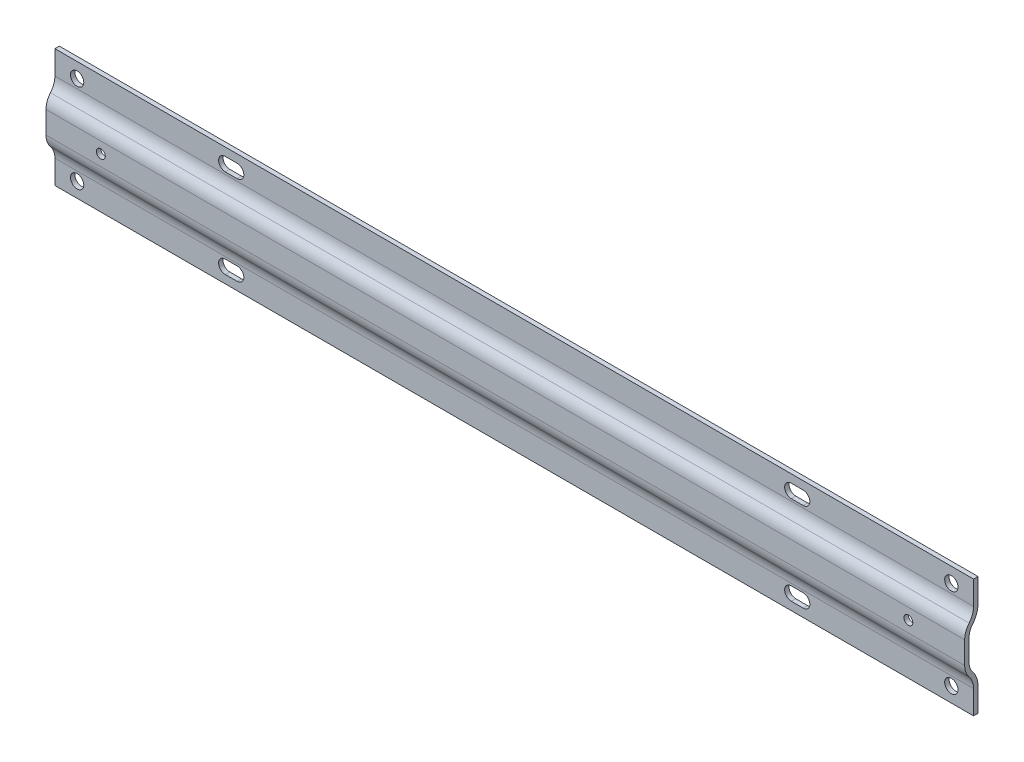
ISO-10303-21;
HEADER;
FILE_DESCRIPTION(('STEP AP214'),'2;1');
FILE_NAME('part.step','',(''),(''),'','','');
FILE_SCHEMA(('AUTOMOTIVE_DESIGN { 1 0 10303 214 1 1 1 1 }'));
ENDSEC;
DATA;
#1=APPLICATION_CONTEXT('core data for automotive mechanical design processes');
#2=APPLICATION_PROTOCOL_DEFINITION('international standard','automotive_design',2000,#1);
#3=PRODUCT_CONTEXT('',#1,'mechanical');
#4=PRODUCT('Part','Part','',(#3));
#5=PRODUCT_RELATED_PRODUCT_CATEGORY('part','',(#4));
#6=PRODUCT_DEFINITION_FORMATION('','',#4);
#7=PRODUCT_DEFINITION_CONTEXT('part definition',#1,'design');
#8=PRODUCT_DEFINITION('design','',#6,#7);
#9=PRODUCT_DEFINITION_SHAPE('','',#8);
#10=(LENGTH_UNIT() NAMED_UNIT(*) SI_UNIT(.MILLI.,.METRE.));
#11=(NAMED_UNIT(*) PLANE_ANGLE_UNIT() SI_UNIT($,.RADIAN.));
#12=(NAMED_UNIT(*) SI_UNIT($,.STERADIAN.) SOLID_ANGLE_UNIT());
#13=UNCERTAINTY_MEASURE_WITH_UNIT(LENGTH_MEASURE(1.E-05),#10,'distance_accuracy_value','');
#14=(GEOMETRIC_REPRESENTATION_CONTEXT(3) GLOBAL_UNCERTAINTY_ASSIGNED_CONTEXT((#13)) GLOBAL_UNIT_ASSIGNED_CONTEXT((#10,
#11,#12)) REPRESENTATION_CONTEXT('',''));
#15=CARTESIAN_POINT('',(0.,0.,0.));
#16=DIRECTION('',(0.,0.,1.));
#17=DIRECTION('',(1.,0.,0.));
#18=AXIS2_PLACEMENT_3D('',#15,#16,#17);
#19=CARTESIAN_POINT('',(-620.000000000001,24.0000000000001,-8.9999999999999));
#20=DIRECTION('',(0.,0.,-1.));
#21=DIRECTION('',(0.,1.,0.));
#22=AXIS2_PLACEMENT_3D('',#19,#20,#21);
#23=PLANE('',#22);
#24=CARTESIAN_POINT('',(-605.000000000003,29.9999999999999,-8.99999999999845));
#25=DIRECTION('',(0.,0.,1.));
#26=DIRECTION('',(-1.,0.,0.));
#27=AXIS2_PLACEMENT_3D('',#24,#25,#26);
#28=CIRCLE('',#27,4.50000000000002);
#29=CARTESIAN_POINT('',(-600.500000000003,29.9999999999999,-8.99999999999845));
#30=VERTEX_POINT('',#29);
#31=EDGE_CURVE('E279',#30,#30,#28,.T.);
#32=ORIENTED_EDGE('',*,*,#31,.T.);
#33=EDGE_LOOP('',(#32));
#34=FACE_BOUND('',#33,.T.);
#35=CARTESIAN_POINT('',(-497.000000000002,29.9999999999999,-8.99999999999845));
#36=DIRECTION('',(0.,0.,1.));
#37=DIRECTION('',(-1.,0.,0.));
#38=AXIS2_PLACEMENT_3D('',#35,#36,#37);
#39=CIRCLE('',#38,4.50000000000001);
#40=CARTESIAN_POINT('',(-497.000000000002,25.5000000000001,-8.9999999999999));
#41=VERTEX_POINT('',#40);
#42=CARTESIAN_POINT('',(-497.000000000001,34.5,-8.9999999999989));
#43=VERTEX_POINT('',#42);
#44=EDGE_CURVE('E290',#41,#43,#39,.T.);
#45=ORIENTED_EDGE('',*,*,#44,.T.);
#46=DIRECTION('',(-1.,0.,0.));
#47=VECTOR('',#46,1.);
#48=CARTESIAN_POINT('',(-497.000000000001,34.5,-8.9999999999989));
#49=LINE('',#48,#47);
#50=CARTESIAN_POINT('',(-505.000000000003,34.4999999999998,-8.99999999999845));
#51=VERTEX_POINT('',#50);
#52=EDGE_CURVE('E300',#43,#51,#49,.T.);
#53=ORIENTED_EDGE('',*,*,#52,.T.);
#54=CARTESIAN_POINT('',(-505.000000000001,29.9999999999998,-8.9999999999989));
#55=DIRECTION('',(0.,0.,1.));
#56=DIRECTION('',(-1.,0.,0.));
#57=AXIS2_PLACEMENT_3D('',#54,#55,#56);
#58=CIRCLE('',#57,4.50000000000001);
#59=CARTESIAN_POINT('',(-505.,25.5000000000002,-8.9999999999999));
#60=VERTEX_POINT('',#59);
#61=EDGE_CURVE('E304',#51,#60,#58,.T.);
#62=ORIENTED_EDGE('',*,*,#61,.T.);
#63=DIRECTION('',(1.,0.,0.));
#64=VECTOR('',#63,1.);
#65=CARTESIAN_POINT('',(-497.000000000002,25.5000000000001,-8.9999999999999));
#66=LINE('',#65,#64);
#67=EDGE_CURVE('E308',#60,#41,#66,.T.);
#68=ORIENTED_EDGE('',*,*,#67,.T.);
#69=EDGE_LOOP('',(#45,#53,#62,#68));
#70=FACE_BOUND('',#69,.T.);
#71=CARTESIAN_POINT('',(-123.000000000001,30.0000000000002,-8.9999999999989));
#72=DIRECTION('',(0.,0.,1.));
#73=DIRECTION('',(1.,0.,0.));
#74=AXIS2_PLACEMENT_3D('',#71,#72,#73);
#75=CIRCLE('',#74,4.50000000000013);
#76=CARTESIAN_POINT('',(-123.,34.5000000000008,-8.99999999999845));
#77=VERTEX_POINT('',#76);
#78=CARTESIAN_POINT('',(-123.000000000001,25.5,-8.9999999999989));
#79=VERTEX_POINT('',#78);
#80=EDGE_CURVE('E379',#77,#79,#75,.T.);
#81=ORIENTED_EDGE('',*,*,#80,.T.);
#82=DIRECTION('',(1.,0.,0.));
#83=VECTOR('',#82,1.);
#84=CARTESIAN_POINT('',(-123.000000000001,25.5,-8.9999999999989));
#85=LINE('',#84,#83);
#86=CARTESIAN_POINT('',(-115.,25.4999999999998,-8.99999999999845));
#87=VERTEX_POINT('',#86);
#88=EDGE_CURVE('E383',#79,#87,#85,.T.);
#89=ORIENTED_EDGE('',*,*,#88,.T.);
#90=CARTESIAN_POINT('',(-115.,30.0000000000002,-8.99999999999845));
#91=DIRECTION('',(0.,0.,1.));
#92=DIRECTION('',(1.,0.,0.));
#93=AXIS2_PLACEMENT_3D('',#90,#91,#92);
#94=CIRCLE('',#93,4.50000000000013);
#95=CARTESIAN_POINT('',(-115.,34.5000000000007,-8.9999999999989));
#96=VERTEX_POINT('',#95);
#97=EDGE_CURVE('E387',#87,#96,#94,.T.);
#98=ORIENTED_EDGE('',*,*,#97,.T.);
#99=DIRECTION('',(-1.,0.,0.));
#100=VECTOR('',#99,1.);
#101=CARTESIAN_POINT('',(-123.,34.5000000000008,-8.99999999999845));
#102=LINE('',#101,#100);
#103=EDGE_CURVE('E391',#96,#77,#102,.T.);
#104=ORIENTED_EDGE('',*,*,#103,.T.);
#105=EDGE_LOOP('',(#81,#89,#98,#104));
#106=FACE_BOUND('',#105,.T.);
#107=CARTESIAN_POINT('',(-15.0000000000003,30.0000000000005,-8.99999999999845));
#108=DIRECTION('',(0.,0.,1.));
#109=DIRECTION('',(1.,0.,0.));
#110=AXIS2_PLACEMENT_3D('',#107,#108,#109);
#111=CIRCLE('',#110,4.5);
#112=CARTESIAN_POINT('',(-10.5000000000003,30.0000000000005,-8.99999999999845));
#113=VERTEX_POINT('',#112);
#114=EDGE_CURVE('E400',#113,#113,#111,.T.);
#115=ORIENTED_EDGE('',*,*,#114,.T.);
#116=EDGE_LOOP('',(#115));
#117=FACE_BOUND('',#116,.T.);
#118=DIRECTION('',(0.,1.,0.));
#119=VECTOR('',#118,1.);
#120=CARTESIAN_POINT('',(-2.22044604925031E-13,23.9999999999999,-8.99999999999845));
#121=LINE('',#120,#119);
#122=CARTESIAN_POINT('',(-2.22044604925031E-13,23.9999999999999,-8.99999999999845));
#123=VERTEX_POINT('',#122);
#124=CARTESIAN_POINT('',(-3.33066907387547E-13,40.0000000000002,-8.9999999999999));
#125=VERTEX_POINT('',#124);
#126=EDGE_CURVE('E481',#123,#125,#121,.T.);
#127=ORIENTED_EDGE('',*,*,#126,.F.);
#128=DIRECTION('',(1.,0.,0.));
#129=VECTOR('',#128,1.);
#130=CARTESIAN_POINT('',(-620.000000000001,24.0000000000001,-8.9999999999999));
#131=LINE('',#130,#129);
#132=CARTESIAN_POINT('',(-620.000000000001,24.0000000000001,-8.9999999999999));
#133=VERTEX_POINT('',#132);
#134=EDGE_CURVE('E544',#133,#123,#131,.T.);
#135=ORIENTED_EDGE('',*,*,#134,.F.);
#136=DIRECTION('',(0.,1.,0.));
#137=VECTOR('',#136,1.);
#138=CARTESIAN_POINT('',(-620.000000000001,24.0000000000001,-8.9999999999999));
#139=LINE('',#138,#137);
#140=CARTESIAN_POINT('',(-620.000000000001,39.9999999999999,-8.9999999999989));
#141=VERTEX_POINT('',#140);
#142=EDGE_CURVE('E415',#133,#141,#139,.T.);
#143=ORIENTED_EDGE('',*,*,#142,.T.);
#144=DIRECTION('',(1.,0.,0.));
#145=VECTOR('',#144,1.);
#146=CARTESIAN_POINT('',(-620.000000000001,39.9999999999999,-8.9999999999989));
#147=LINE('',#146,#145);
#148=EDGE_CURVE('E480',#141,#125,#147,.T.);
#149=ORIENTED_EDGE('',*,*,#148,.T.);
#150=EDGE_LOOP('',(#127,#135,#143,#149));
#151=FACE_BOUND('',#150,.T.);
#152=ADVANCED_FACE('F42',(#34,#70,#106,#117,#151),#23,.T.);
#153=CARTESIAN_POINT('',(-620.000000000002,24.0000000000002,6.84375000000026));
#154=DIRECTION('',(1.,0.,0.));
#155=DIRECTION('',(0.,0.,-1.));
#156=AXIS2_PLACEMENT_3D('',#153,#154,#155);
#157=CYLINDRICAL_SURFACE('',#156,15.84375);
#158=CARTESIAN_POINT('',(2.22044604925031E-13,24.0000000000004,6.84375000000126));
#159=DIRECTION('',(1.,0.,0.));
#160=DIRECTION('',(0.,0.,1.));
#161=AXIS2_PLACEMENT_3D('',#158,#159,#160);
#162=CIRCLE('',#161,15.84375);
#163=CARTESIAN_POINT('',(6.66133814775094E-13,13.8229927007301,-5.29927007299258));
#164=VERTEX_POINT('',#163);
#165=EDGE_CURVE('E420',#164,#123,#162,.T.);
#166=ORIENTED_EDGE('',*,*,#165,.F.);
#167=DIRECTION('',(1.,0.,0.));
#168=VECTOR('',#167,1.);
#169=CARTESIAN_POINT('',(-620.000000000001,13.8229927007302,-5.2992700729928));
#170=LINE('',#169,#168);
#171=CARTESIAN_POINT('',(-620.000000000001,13.8229927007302,-5.2992700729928));
#172=VERTEX_POINT('',#171);
#173=EDGE_CURVE('E548',#172,#164,#170,.T.);
#174=ORIENTED_EDGE('',*,*,#173,.F.);
#175=CARTESIAN_POINT('',(-620.000000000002,24.0000000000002,6.84375000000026));
#176=DIRECTION('',(1.,0.,0.));
#177=DIRECTION('',(0.,0.,1.));
#178=AXIS2_PLACEMENT_3D('',#175,#176,#177);
#179=CIRCLE('',#178,15.84375);
#180=EDGE_CURVE('E476',#172,#133,#179,.T.);
#181=ORIENTED_EDGE('',*,*,#180,.T.);
#182=ORIENTED_EDGE('',*,*,#134,.T.);
#183=EDGE_LOOP('',(#166,#174,#181,#182));
#184=FACE_BOUND('',#183,.T.);
#185=ADVANCED_FACE('F662',(#184),#157,.T.);
#186=CARTESIAN_POINT('',(-620.000000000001,7.50000000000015,-12.8437499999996));
#187=DIRECTION('',(1.,0.,0.));
#188=DIRECTION('',(0.,0.,-1.));
#189=AXIS2_PLACEMENT_3D('',#186,#187,#188);
#190=CYLINDRICAL_SURFACE('',#189,9.84375000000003);
#191=CARTESIAN_POINT('',(-4.44089209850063E-13,7.5000000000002,-12.84375));
#192=DIRECTION('',(-1.,0.,0.));
#193=DIRECTION('',(0.,0.,-1.));
#194=AXIS2_PLACEMENT_3D('',#191,#192,#193);
#195=CIRCLE('',#194,9.84375000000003);
#196=CARTESIAN_POINT('',(-5.55111512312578E-13,7.50000000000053,-3.00000000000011));
#197=VERTEX_POINT('',#196);
#198=EDGE_CURVE('E537',#197,#164,#195,.T.);
#199=ORIENTED_EDGE('',*,*,#198,.F.);
#200=DIRECTION('',(1.,0.,0.));
#201=VECTOR('',#200,1.);
#202=CARTESIAN_POINT('',(-620.,7.49999999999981,-3.00000000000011));
#203=LINE('',#202,#201);
#204=CARTESIAN_POINT('',(-620.,7.49999999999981,-3.00000000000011));
#205=VERTEX_POINT('',#204);
#206=EDGE_CURVE('E551',#205,#197,#203,.T.);
#207=ORIENTED_EDGE('',*,*,#206,.F.);
#208=CARTESIAN_POINT('',(-620.000000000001,7.50000000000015,-12.8437499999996));
#209=DIRECTION('',(-1.,0.,0.));
#210=DIRECTION('',(0.,0.,-1.));
#211=AXIS2_PLACEMENT_3D('',#208,#209,#210);
#212=CIRCLE('',#211,9.84375000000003);
#213=EDGE_CURVE('E472',#205,#172,#212,.T.);
#214=ORIENTED_EDGE('',*,*,#213,.T.);
#215=ORIENTED_EDGE('',*,*,#173,.T.);
#216=EDGE_LOOP('',(#199,#207,#214,#215));
#217=FACE_BOUND('',#216,.T.);
#218=ADVANCED_FACE('F667',(#217),#190,.F.);
#219=CARTESIAN_POINT('',(-620.000000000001,-7.4999999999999,-2.99999999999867));
#220=DIRECTION('',(0.,0.,-1.));
#221=DIRECTION('',(0.,1.,0.));
#222=AXIS2_PLACEMENT_3D('',#219,#220,#221);
#223=PLANE('',#222);
#224=CARTESIAN_POINT('',(-583.000000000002,-3.33066907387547E-13,-2.99999999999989));
#225=DIRECTION('',(0.,0.,-1.));
#226=DIRECTION('',(0.,1.,0.));
#227=AXIS2_PLACEMENT_3D('',#224,#225,#226);
#228=CIRCLE('',#227,3.00000000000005);
#229=CARTESIAN_POINT('',(-580.000000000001,1.11532311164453E-13,-2.99999999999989));
#230=VERTEX_POINT('',#229);
#231=EDGE_CURVE('E367',#230,#230,#228,.T.);
#232=ORIENTED_EDGE('',*,*,#231,.F.);
#233=EDGE_LOOP('',(#232));
#234=FACE_BOUND('',#233,.T.);
#235=CARTESIAN_POINT('',(-38.0000000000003,-1.11022302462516E-13,-2.99999999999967));
#236=DIRECTION('',(0.,0.,-1.));
#237=DIRECTION('',(0.,1.,0.));
#238=AXIS2_PLACEMENT_3D('',#235,#236,#237);
#239=CIRCLE('',#238,3.);
#240=CARTESIAN_POINT('',(-35.0000000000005,-3.3255689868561E-13,-2.99999999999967));
#241=VERTEX_POINT('',#240);
#242=EDGE_CURVE('E375',#241,#241,#239,.T.);
#243=ORIENTED_EDGE('',*,*,#242,.F.);
#244=EDGE_LOOP('',(#243));
#245=FACE_BOUND('',#244,.T.);
#246=DIRECTION('',(0.,1.,0.));
#247=VECTOR('',#246,1.);
#248=CARTESIAN_POINT('',(-3.33066907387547E-13,-7.49999999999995,-3.00000000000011));
#249=LINE('',#248,#247);
#250=CARTESIAN_POINT('',(-3.33066907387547E-13,-7.49999999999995,-3.00000000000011));
#251=VERTEX_POINT('',#250);
#252=EDGE_CURVE('E533',#251,#197,#249,.T.);
#253=ORIENTED_EDGE('',*,*,#252,.F.);
#254=DIRECTION('',(1.,0.,0.));
#255=VECTOR('',#254,1.);
#256=CARTESIAN_POINT('',(-620.000000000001,-7.4999999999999,-2.99999999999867));
#257=LINE('',#256,#255);
#258=CARTESIAN_POINT('',(-620.000000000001,-7.4999999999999,-2.99999999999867));
#259=VERTEX_POINT('',#258);
#260=EDGE_CURVE('E554',#259,#251,#257,.T.);
#261=ORIENTED_EDGE('',*,*,#260,.F.);
#262=DIRECTION('',(0.,1.,0.));
#263=VECTOR('',#262,1.);
#264=CARTESIAN_POINT('',(-620.000000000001,-7.4999999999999,-2.99999999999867));
#265=LINE('',#264,#263);
#266=EDGE_CURVE('E468',#259,#205,#265,.T.);
#267=ORIENTED_EDGE('',*,*,#266,.T.);
#268=ORIENTED_EDGE('',*,*,#206,.T.);
#269=EDGE_LOOP('',(#253,#261,#267,#268));
#270=FACE_BOUND('',#269,.T.);
#271=ADVANCED_FACE('F738',(#234,#245,#270),#223,.T.);
#272=CARTESIAN_POINT('',(-620.000000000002,-7.49999999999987,-12.843749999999));
#273=DIRECTION('',(1.,0.,0.));
#274=DIRECTION('',(0.,0.,-1.));
#275=AXIS2_PLACEMENT_3D('',#272,#273,#274);
#276=CYLINDRICAL_SURFACE('',#275,9.84375000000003);
#277=CARTESIAN_POINT('',(-7.7715611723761E-13,-7.4999999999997,-12.84375));
#278=DIRECTION('',(-1.,0.,0.));
#279=DIRECTION('',(0.,0.,1.));
#280=AXIS2_PLACEMENT_3D('',#277,#278,#279);
#281=CIRCLE('',#280,9.84375000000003);
#282=CARTESIAN_POINT('',(-6.66133814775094E-13,-13.8229927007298,-5.29927007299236));
#283=VERTEX_POINT('',#282);
#284=EDGE_CURVE('E529',#283,#251,#281,.T.);
#285=ORIENTED_EDGE('',*,*,#284,.F.);
#286=DIRECTION('',(1.,0.,0.));
#287=VECTOR('',#286,1.);
#288=CARTESIAN_POINT('',(-620.000000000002,-13.8229927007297,-5.29927007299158));
#289=LINE('',#288,#287);
#290=CARTESIAN_POINT('',(-620.000000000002,-13.8229927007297,-5.29927007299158));
#291=VERTEX_POINT('',#290);
#292=EDGE_CURVE('E557',#291,#283,#289,.T.);
#293=ORIENTED_EDGE('',*,*,#292,.F.);
#294=CARTESIAN_POINT('',(-620.000000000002,-7.49999999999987,-12.843749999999));
#295=DIRECTION('',(-1.,0.,0.));
#296=DIRECTION('',(0.,0.,1.));
#297=AXIS2_PLACEMENT_3D('',#294,#295,#296);
#298=CIRCLE('',#297,9.84375000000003);
#299=EDGE_CURVE('E464',#291,#259,#298,.T.);
#300=ORIENTED_EDGE('',*,*,#299,.T.);
#301=ORIENTED_EDGE('',*,*,#260,.T.);
#302=EDGE_LOOP('',(#285,#293,#300,#301));
#303=FACE_BOUND('',#302,.T.);
#304=ADVANCED_FACE('F735',(#303),#276,.F.);
#305=CARTESIAN_POINT('',(-620.000000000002,-23.9999999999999,6.84375000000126));
#306=DIRECTION('',(1.,0.,0.));
#307=DIRECTION('',(0.,0.,-1.));
#308=AXIS2_PLACEMENT_3D('',#305,#306,#307);
#309=CYLINDRICAL_SURFACE('',#308,15.84375);
#310=CARTESIAN_POINT('',(-6.66133814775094E-13,-24.0000000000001,6.84375000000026));
#311=DIRECTION('',(1.,0.,0.));
#312=DIRECTION('',(0.,0.,-1.));
#313=AXIS2_PLACEMENT_3D('',#310,#311,#312);
#314=CIRCLE('',#313,15.84375);
#315=CARTESIAN_POINT('',(-5.55111512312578E-13,-24.,-8.9999999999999));
#316=VERTEX_POINT('',#315);
#317=EDGE_CURVE('E525',#316,#283,#314,.T.);
#318=ORIENTED_EDGE('',*,*,#317,.F.);
#319=DIRECTION('',(1.,0.,0.));
#320=VECTOR('',#319,1.);
#321=CARTESIAN_POINT('',(-620.000000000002,-24.0000000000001,-8.99999999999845));
#322=LINE('',#321,#320);
#323=CARTESIAN_POINT('',(-620.000000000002,-24.0000000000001,-8.99999999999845));
#324=VERTEX_POINT('',#323);
#325=EDGE_CURVE('E560',#324,#316,#322,.T.);
#326=ORIENTED_EDGE('',*,*,#325,.F.);
#327=CARTESIAN_POINT('',(-620.000000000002,-23.9999999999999,6.84375000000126));
#328=DIRECTION('',(1.,0.,0.));
#329=DIRECTION('',(0.,0.,-1.));
#330=AXIS2_PLACEMENT_3D('',#327,#328,#329);
#331=CIRCLE('',#330,15.84375);
#332=EDGE_CURVE('E460',#324,#291,#331,.T.);
#333=ORIENTED_EDGE('',*,*,#332,.T.);
#334=ORIENTED_EDGE('',*,*,#292,.T.);
#335=EDGE_LOOP('',(#318,#326,#333,#334));
#336=FACE_BOUND('',#335,.T.);
#337=ADVANCED_FACE('F731',(#336),#309,.T.);
#338=CARTESIAN_POINT('',(-620.000000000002,-40.0000000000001,-8.9999999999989));
#339=DIRECTION('',(0.,0.,-1.));
#340=DIRECTION('',(0.,1.,0.));
#341=AXIS2_PLACEMENT_3D('',#338,#339,#340);
#342=PLANE('',#341);
#343=CARTESIAN_POINT('',(-605.000000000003,-29.9999999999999,-8.9999999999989));
#344=DIRECTION('',(0.,0.,1.));
#345=DIRECTION('',(1.,0.,0.));
#346=AXIS2_PLACEMENT_3D('',#343,#344,#345);
#347=CIRCLE('',#346,4.50000000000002);
#348=CARTESIAN_POINT('',(-600.500000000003,-29.9999999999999,-8.9999999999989));
#349=VERTEX_POINT('',#348);
#350=EDGE_CURVE('E1216',#349,#349,#347,.T.);
#351=ORIENTED_EDGE('',*,*,#350,.T.);
#352=EDGE_LOOP('',(#351));
#353=FACE_BOUND('',#352,.T.);
#354=CARTESIAN_POINT('',(-497.000000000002,-30.,-8.9999999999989));
#355=DIRECTION('',(0.,0.,1.));
#356=DIRECTION('',(1.,0.,0.));
#357=AXIS2_PLACEMENT_3D('',#354,#355,#356);
#358=CIRCLE('',#357,4.50000000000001);
#359=CARTESIAN_POINT('',(-497.000000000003,-34.5000000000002,-8.99999999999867));
#360=VERTEX_POINT('',#359);
#361=CARTESIAN_POINT('',(-497.000000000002,-25.4999999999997,-8.9999999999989));
#362=VERTEX_POINT('',#361);
#363=EDGE_CURVE('E255',#360,#362,#358,.T.);
#364=ORIENTED_EDGE('',*,*,#363,.T.);
#365=DIRECTION('',(-1.,0.,0.));
#366=VECTOR('',#365,1.);
#367=CARTESIAN_POINT('',(-497.000000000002,-25.4999999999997,-8.9999999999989));
#368=LINE('',#367,#366);
#369=CARTESIAN_POINT('',(-505.000000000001,-25.5000000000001,-8.9999999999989));
#370=VERTEX_POINT('',#369);
#371=EDGE_CURVE('E264',#362,#370,#368,.T.);
#372=ORIENTED_EDGE('',*,*,#371,.T.);
#373=CARTESIAN_POINT('',(-505.000000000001,-29.9999999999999,-8.99999999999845));
#374=DIRECTION('',(0.,0.,1.));
#375=DIRECTION('',(1.,0.,0.));
#376=AXIS2_PLACEMENT_3D('',#373,#374,#375);
#377=CIRCLE('',#376,4.50000000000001);
#378=CARTESIAN_POINT('',(-505.000000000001,-34.5000000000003,-8.9999999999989));
#379=VERTEX_POINT('',#378);
#380=EDGE_CURVE('E59',#370,#379,#377,.T.);
#381=ORIENTED_EDGE('',*,*,#380,.T.);
#382=DIRECTION('',(1.,0.,0.));
#383=VECTOR('',#382,1.);
#384=CARTESIAN_POINT('',(-497.000000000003,-34.5000000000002,-8.99999999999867));
#385=LINE('',#384,#383);
#386=EDGE_CURVE('E261',#379,#360,#385,.T.);
#387=ORIENTED_EDGE('',*,*,#386,.T.);
#388=EDGE_LOOP('',(#364,#372,#381,#387));
#389=FACE_BOUND('',#388,.T.);
#390=CARTESIAN_POINT('',(-15.0000000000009,-29.9999999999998,-8.9999999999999));
#391=DIRECTION('',(0.,0.,1.));
#392=DIRECTION('',(-1.,0.,0.));
#393=AXIS2_PLACEMENT_3D('',#390,#391,#392);
#394=CIRCLE('',#393,4.5);
#395=CARTESIAN_POINT('',(-10.5000000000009,-29.9999999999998,-8.9999999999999));
#396=VERTEX_POINT('',#395);
#397=EDGE_CURVE('E317',#396,#396,#394,.T.);
#398=ORIENTED_EDGE('',*,*,#397,.T.);
#399=EDGE_LOOP('',(#398));
#400=FACE_BOUND('',#399,.T.);
#401=CARTESIAN_POINT('',(-123.000000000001,-30.,-8.9999999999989));
#402=DIRECTION('',(0.,0.,1.));
#403=DIRECTION('',(-1.,0.,0.));
#404=AXIS2_PLACEMENT_3D('',#401,#402,#403);
#405=CIRCLE('',#404,4.50000000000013);
#406=CARTESIAN_POINT('',(-123.,-25.4999999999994,-8.99999999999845));
#407=VERTEX_POINT('',#406);
#408=CARTESIAN_POINT('',(-123.000000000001,-34.4999999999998,-8.9999999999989));
#409=VERTEX_POINT('',#408);
#410=EDGE_CURVE('E332',#407,#409,#405,.T.);
#411=ORIENTED_EDGE('',*,*,#410,.T.);
#412=DIRECTION('',(1.,0.,0.));
#413=VECTOR('',#412,1.);
#414=CARTESIAN_POINT('',(-123.000000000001,-34.4999999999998,-8.9999999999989));
#415=LINE('',#414,#413);
#416=CARTESIAN_POINT('',(-115.,-34.5000000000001,-8.9999999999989));
#417=VERTEX_POINT('',#416);
#418=EDGE_CURVE('E336',#409,#417,#415,.T.);
#419=ORIENTED_EDGE('',*,*,#418,.T.);
#420=CARTESIAN_POINT('',(-115.,-30.,-8.9999999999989));
#421=DIRECTION('',(0.,0.,1.));
#422=DIRECTION('',(-1.,0.,0.));
#423=AXIS2_PLACEMENT_3D('',#420,#421,#422);
#424=CIRCLE('',#423,4.50000000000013);
#425=CARTESIAN_POINT('',(-115.000000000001,-25.4999999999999,-8.99999999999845));
#426=VERTEX_POINT('',#425);
#427=EDGE_CURVE('E340',#417,#426,#424,.T.);
#428=ORIENTED_EDGE('',*,*,#427,.T.);
#429=DIRECTION('',(-1.,0.,0.));
#430=VECTOR('',#429,1.);
#431=CARTESIAN_POINT('',(-123.,-25.4999999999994,-8.99999999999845));
#432=LINE('',#431,#430);
#433=EDGE_CURVE('E344',#426,#407,#432,.T.);
#434=ORIENTED_EDGE('',*,*,#433,.T.);
#435=EDGE_LOOP('',(#411,#419,#428,#434));
#436=FACE_BOUND('',#435,.T.);
#437=DIRECTION('',(0.,1.,0.));
#438=VECTOR('',#437,1.);
#439=CARTESIAN_POINT('',(-1.22124532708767E-12,-39.9999999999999,-8.99999999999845));
#440=LINE('',#439,#438);
#441=CARTESIAN_POINT('',(-1.22124532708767E-12,-39.9999999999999,-8.99999999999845));
#442=VERTEX_POINT('',#441);
#443=EDGE_CURVE('E521',#442,#316,#440,.T.);
#444=ORIENTED_EDGE('',*,*,#443,.F.);
#445=DIRECTION('',(1.,0.,0.));
#446=VECTOR('',#445,1.);
#447=CARTESIAN_POINT('',(-620.000000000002,-40.0000000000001,-8.9999999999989));
#448=LINE('',#447,#446);
#449=CARTESIAN_POINT('',(-620.000000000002,-40.0000000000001,-8.9999999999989));
#450=VERTEX_POINT('',#449);
#451=EDGE_CURVE('E563',#450,#442,#448,.T.);
#452=ORIENTED_EDGE('',*,*,#451,.F.);
#453=DIRECTION('',(0.,1.,0.));
#454=VECTOR('',#453,1.);
#455=CARTESIAN_POINT('',(-620.000000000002,-40.0000000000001,-8.9999999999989));
#456=LINE('',#455,#454);
#457=EDGE_CURVE('E456',#450,#324,#456,.T.);
#458=ORIENTED_EDGE('',*,*,#457,.T.);
#459=ORIENTED_EDGE('',*,*,#325,.T.);
#460=EDGE_LOOP('',(#444,#452,#458,#459));
#461=FACE_BOUND('',#460,.T.);
#462=ADVANCED_FACE('F269',(#353,#389,#400,#436,#461),#342,.T.);
#463=CARTESIAN_POINT('',(-620.000000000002,-40.0000000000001,-8.9999999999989));
#464=DIRECTION('',(0.,-1.,0.));
#465=DIRECTION('',(0.,0.,-1.));
#466=AXIS2_PLACEMENT_3D('',#463,#464,#465);
#467=PLANE('',#466);
#468=DIRECTION('',(0.,0.,-1.));
#469=VECTOR('',#468,1.);
#470=CARTESIAN_POINT('',(-1.22124532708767E-12,-39.9999999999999,-8.99999999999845));
#471=LINE('',#470,#469);
#472=CARTESIAN_POINT('',(-1.22124532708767E-12,-39.9999999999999,-5.99999999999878));
#473=VERTEX_POINT('',#472);
#474=EDGE_CURVE('E517',#473,#442,#471,.T.);
#475=ORIENTED_EDGE('',*,*,#474,.F.);
#476=DIRECTION('',(1.,0.,0.));
#477=VECTOR('',#476,1.);
#478=CARTESIAN_POINT('',(-620.000000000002,-40.0000000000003,-5.99999999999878));
#479=LINE('',#478,#477);
#480=CARTESIAN_POINT('',(-620.000000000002,-40.0000000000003,-5.99999999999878));
#481=VERTEX_POINT('',#480);
#482=EDGE_CURVE('E566',#481,#473,#479,.T.);
#483=ORIENTED_EDGE('',*,*,#482,.F.);
#484=DIRECTION('',(0.,0.,-1.));
#485=VECTOR('',#484,1.);
#486=CARTESIAN_POINT('',(-620.000000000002,-40.0000000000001,-8.9999999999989));
#487=LINE('',#486,#485);
#488=EDGE_CURVE('E452',#481,#450,#487,.T.);
#489=ORIENTED_EDGE('',*,*,#488,.T.);
#490=ORIENTED_EDGE('',*,*,#451,.T.);
#491=EDGE_LOOP('',(#475,#483,#489,#490));
#492=FACE_BOUND('',#491,.T.);
#493=ADVANCED_FACE('F724',(#492),#467,.T.);
#494=CARTESIAN_POINT('',(-620.000000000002,-40.0000000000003,-5.99999999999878));
#495=DIRECTION('',(0.,0.,1.));
#496=DIRECTION('',(0.,-1.,0.));
#497=AXIS2_PLACEMENT_3D('',#494,#495,#496);
#498=PLANE('',#497);
#499=CARTESIAN_POINT('',(-605.000000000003,-30.0000000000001,-5.99999999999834));
#500=DIRECTION('',(0.,0.,1.));
#501=DIRECTION('',(0.,-1.,0.));
#502=AXIS2_PLACEMENT_3D('',#499,#500,#501);
#503=CIRCLE('',#502,4.50000000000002);
#504=CARTESIAN_POINT('',(-600.500000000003,-29.9999999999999,-5.99999999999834));
#505=VERTEX_POINT('',#504);
#506=EDGE_CURVE('E45',#505,#505,#503,.T.);
#507=ORIENTED_EDGE('',*,*,#506,.F.);
#508=EDGE_LOOP('',(#507));
#509=FACE_BOUND('',#508,.T.);
#510=CARTESIAN_POINT('',(-497.000000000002,-30.0000000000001,-5.99999999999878));
#511=DIRECTION('',(0.,0.,1.));
#512=DIRECTION('',(0.,-1.,0.));
#513=AXIS2_PLACEMENT_3D('',#510,#511,#512);
#514=CIRCLE('',#513,4.50000000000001);
#515=CARTESIAN_POINT('',(-497.000000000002,-34.5000000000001,-5.99999999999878));
#516=VERTEX_POINT('',#515);
#517=CARTESIAN_POINT('',(-497.000000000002,-25.5,-5.99999999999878));
#518=VERTEX_POINT('',#517);
#519=EDGE_CURVE('E11',#516,#518,#514,.T.);
#520=ORIENTED_EDGE('',*,*,#519,.F.);
#521=DIRECTION('',(1.,0.,0.));
#522=VECTOR('',#521,1.);
#523=CARTESIAN_POINT('',(-620.000000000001,-34.5000000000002,-5.99999999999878));
#524=LINE('',#523,#522);
#525=CARTESIAN_POINT('',(-505.000000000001,-34.5000000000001,-5.99999999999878));
#526=VERTEX_POINT('',#525);
#527=EDGE_CURVE('E51',#526,#516,#524,.T.);
#528=ORIENTED_EDGE('',*,*,#527,.F.);
#529=CARTESIAN_POINT('',(-505.000000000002,-30.0000000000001,-5.99999999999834));
#530=DIRECTION('',(0.,0.,1.));
#531=DIRECTION('',(0.,-1.,0.));
#532=AXIS2_PLACEMENT_3D('',#529,#530,#531);
#533=CIRCLE('',#532,4.50000000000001);
#534=CARTESIAN_POINT('',(-505.000000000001,-25.5000000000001,-5.99999999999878));
#535=VERTEX_POINT('',#534);
#536=EDGE_CURVE('E639',#535,#526,#533,.T.);
#537=ORIENTED_EDGE('',*,*,#536,.F.);
#538=DIRECTION('',(-1.,0.,0.));
#539=VECTOR('',#538,1.);
#540=CARTESIAN_POINT('',(-620.000000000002,-25.4999999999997,-5.99999999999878));
#541=LINE('',#540,#539);
#542=EDGE_CURVE('E636',#518,#535,#541,.T.);
#543=ORIENTED_EDGE('',*,*,#542,.F.);
#544=EDGE_LOOP('',(#520,#528,#537,#543));
#545=FACE_BOUND('',#544,.T.);
#546=CARTESIAN_POINT('',(-15.0000000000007,-30.0000000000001,-5.99999999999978));
#547=DIRECTION('',(0.,0.,1.));
#548=DIRECTION('',(0.,-1.,0.));
#549=AXIS2_PLACEMENT_3D('',#546,#547,#548);
#550=CIRCLE('',#549,4.5);
#551=CARTESIAN_POINT('',(-10.5000000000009,-29.9999999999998,-5.99999999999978));
#552=VERTEX_POINT('',#551);
#553=EDGE_CURVE('E331',#552,#552,#550,.T.);
#554=ORIENTED_EDGE('',*,*,#553,.F.);
#555=EDGE_LOOP('',(#554));
#556=FACE_BOUND('',#555,.T.);
#557=CARTESIAN_POINT('',(-123.000000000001,-29.9999999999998,-5.99999999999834));
#558=DIRECTION('',(0.,0.,1.));
#559=DIRECTION('',(0.,-1.,0.));
#560=AXIS2_PLACEMENT_3D('',#557,#558,#559);
#561=CIRCLE('',#560,4.50000000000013);
#562=CARTESIAN_POINT('',(-123.,-25.4999999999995,-5.99999999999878));
#563=VERTEX_POINT('',#562);
#564=CARTESIAN_POINT('',(-123.000000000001,-34.4999999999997,-5.99999999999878));
#565=VERTEX_POINT('',#564);
#566=EDGE_CURVE('E616',#563,#565,#561,.T.);
#567=ORIENTED_EDGE('',*,*,#566,.F.);
#568=DIRECTION('',(-1.,0.,0.));
#569=VECTOR('',#568,1.);
#570=CARTESIAN_POINT('',(-620.000000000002,-25.4999999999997,-5.99999999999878));
#571=LINE('',#570,#569);
#572=CARTESIAN_POINT('',(-115.000000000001,-25.4999999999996,-5.99999999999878));
#573=VERTEX_POINT('',#572);
#574=EDGE_CURVE('E613',#573,#563,#571,.T.);
#575=ORIENTED_EDGE('',*,*,#574,.F.);
#576=CARTESIAN_POINT('',(-115.,-29.9999999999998,-5.99999999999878));
#577=DIRECTION('',(0.,0.,1.));
#578=DIRECTION('',(0.,-1.,0.));
#579=AXIS2_PLACEMENT_3D('',#576,#577,#578);
#580=CIRCLE('',#579,4.50000000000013);
#581=CARTESIAN_POINT('',(-115.000000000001,-34.4999999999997,-5.99999999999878));
#582=VERTEX_POINT('',#581);
#583=EDGE_CURVE('E610',#582,#573,#580,.T.);
#584=ORIENTED_EDGE('',*,*,#583,.F.);
#585=DIRECTION('',(1.,0.,0.));
#586=VECTOR('',#585,1.);
#587=CARTESIAN_POINT('',(-620.000000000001,-34.5000000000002,-5.99999999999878));
#588=LINE('',#587,#586);
#589=EDGE_CURVE('E607',#565,#582,#588,.T.);
#590=ORIENTED_EDGE('',*,*,#589,.F.);
#591=EDGE_LOOP('',(#567,#575,#584,#590));
#592=FACE_BOUND('',#591,.T.);
#593=DIRECTION('',(0.,-1.,0.));
#594=VECTOR('',#593,1.);
#595=CARTESIAN_POINT('',(-1.22124532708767E-12,-39.9999999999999,-5.99999999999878));
#596=LINE('',#595,#594);
#597=CARTESIAN_POINT('',(-6.66133814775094E-13,-23.9999999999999,-5.99999999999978));
#598=VERTEX_POINT('',#597);
#599=EDGE_CURVE('E513',#598,#473,#596,.T.);
#600=ORIENTED_EDGE('',*,*,#599,.F.);
#601=DIRECTION('',(1.,0.,0.));
#602=VECTOR('',#601,1.);
#603=CARTESIAN_POINT('',(-620.000000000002,-24.0000000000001,-5.99999999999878));
#604=LINE('',#603,#602);
#605=CARTESIAN_POINT('',(-620.000000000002,-24.0000000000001,-5.99999999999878));
#606=VERTEX_POINT('',#605);
#607=EDGE_CURVE('E569',#606,#598,#604,.T.);
#608=ORIENTED_EDGE('',*,*,#607,.F.);
#609=DIRECTION('',(0.,-1.,0.));
#610=VECTOR('',#609,1.);
#611=CARTESIAN_POINT('',(-620.000000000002,-40.0000000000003,-5.99999999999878));
#612=LINE('',#611,#610);
#613=EDGE_CURVE('E448',#606,#481,#612,.T.);
#614=ORIENTED_EDGE('',*,*,#613,.T.);
#615=ORIENTED_EDGE('',*,*,#482,.T.);
#616=EDGE_LOOP('',(#600,#608,#614,#615));
#617=FACE_BOUND('',#616,.T.);
#618=ADVANCED_FACE('F649',(#509,#545,#556,#592,#617),#498,.T.);
#619=CARTESIAN_POINT('',(-620.000000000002,-23.9999999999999,6.84375000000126));
#620=DIRECTION('',(1.,0.,0.));
#621=DIRECTION('',(0.,0.,-1.));
#622=AXIS2_PLACEMENT_3D('',#619,#620,#621);
#623=CYLINDRICAL_SURFACE('',#622,12.84375);
#624=CARTESIAN_POINT('',(-6.66133814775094E-13,-24.0000000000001,6.84375000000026));
#625=DIRECTION('',(-1.,0.,0.));
#626=DIRECTION('',(0.,0.,-1.));
#627=AXIS2_PLACEMENT_3D('',#624,#625,#626);
#628=CIRCLE('',#627,12.84375);
#629=CARTESIAN_POINT('',(-5.55111512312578E-13,-15.75,-3.00000000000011));
#630=VERTEX_POINT('',#629);
#631=EDGE_CURVE('E509',#630,#598,#628,.T.);
#632=ORIENTED_EDGE('',*,*,#631,.F.);
#633=DIRECTION('',(1.,0.,0.));
#634=VECTOR('',#633,1.);
#635=CARTESIAN_POINT('',(-620.000000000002,-15.7500000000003,-2.99999999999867));
#636=LINE('',#635,#634);
#637=CARTESIAN_POINT('',(-620.000000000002,-15.7500000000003,-2.99999999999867));
#638=VERTEX_POINT('',#637);
#639=EDGE_CURVE('E572',#638,#630,#636,.T.);
#640=ORIENTED_EDGE('',*,*,#639,.F.);
#641=CARTESIAN_POINT('',(-620.000000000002,-23.9999999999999,6.84375000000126));
#642=DIRECTION('',(-1.,0.,0.));
#643=DIRECTION('',(0.,0.,-1.));
#644=AXIS2_PLACEMENT_3D('',#641,#642,#643);
#645=CIRCLE('',#644,12.84375);
#646=EDGE_CURVE('E444',#638,#606,#645,.T.);
#647=ORIENTED_EDGE('',*,*,#646,.T.);
#648=ORIENTED_EDGE('',*,*,#607,.T.);
#649=EDGE_LOOP('',(#632,#640,#647,#648));
#650=FACE_BOUND('',#649,.T.);
#651=ADVANCED_FACE('F717',(#650),#623,.F.);
#652=CARTESIAN_POINT('',(-620.000000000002,-7.49999999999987,-12.843749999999));
#653=DIRECTION('',(1.,0.,0.));
#654=DIRECTION('',(0.,0.,-1.));
#655=AXIS2_PLACEMENT_3D('',#652,#653,#654);
#656=CYLINDRICAL_SURFACE('',#655,12.84375);
#657=CARTESIAN_POINT('',(-7.7715611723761E-13,-7.4999999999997,-12.84375));
#658=DIRECTION('',(1.,0.,0.));
#659=DIRECTION('',(0.,0.,1.));
#660=AXIS2_PLACEMENT_3D('',#657,#658,#659);
#661=CIRCLE('',#660,12.84375);
#662=CARTESIAN_POINT('',(-4.44089209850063E-13,-7.50000000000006,4.44089209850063E-13));
#663=VERTEX_POINT('',#662);
#664=EDGE_CURVE('E505',#663,#630,#661,.T.);
#665=ORIENTED_EDGE('',*,*,#664,.F.);
#666=DIRECTION('',(1.,0.,0.));
#667=VECTOR('',#666,1.);
#668=CARTESIAN_POINT('',(-620.000000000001,-7.50000000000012,1.66533453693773E-12));
#669=LINE('',#668,#667);
#670=CARTESIAN_POINT('',(-620.000000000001,-7.50000000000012,1.66533453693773E-12));
#671=VERTEX_POINT('',#670);
#672=EDGE_CURVE('E575',#671,#663,#669,.T.);
#673=ORIENTED_EDGE('',*,*,#672,.F.);
#674=CARTESIAN_POINT('',(-620.000000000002,-7.49999999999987,-12.843749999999));
#675=DIRECTION('',(1.,0.,0.));
#676=DIRECTION('',(0.,0.,1.));
#677=AXIS2_PLACEMENT_3D('',#674,#675,#676);
#678=CIRCLE('',#677,12.84375);
#679=EDGE_CURVE('E440',#671,#638,#678,.T.);
#680=ORIENTED_EDGE('',*,*,#679,.T.);
#681=ORIENTED_EDGE('',*,*,#639,.T.);
#682=EDGE_LOOP('',(#665,#673,#680,#681));
#683=FACE_BOUND('',#682,.T.);
#684=ADVANCED_FACE('F713',(#683),#656,.T.);
#685=CARTESIAN_POINT('',(-620.000000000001,7.49999999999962,0.));
#686=DIRECTION('',(0.,0.,1.));
#687=DIRECTION('',(0.,-1.,0.));
#688=AXIS2_PLACEMENT_3D('',#685,#686,#687);
#689=PLANE('',#688);
#690=CARTESIAN_POINT('',(-583.000000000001,-3.05311331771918E-13,0.));
#691=DIRECTION('',(0.,0.,1.));
#692=DIRECTION('',(1.,0.,0.));
#693=AXIS2_PLACEMENT_3D('',#690,#691,#692);
#694=CIRCLE('',#693,3.00000000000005);
#695=CARTESIAN_POINT('',(-580.000000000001,1.11365777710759E-13,0.));
#696=VERTEX_POINT('',#695);
#697=EDGE_CURVE('E353',#696,#696,#694,.T.);
#698=ORIENTED_EDGE('',*,*,#697,.F.);
#699=EDGE_LOOP('',(#698));
#700=FACE_BOUND('',#699,.T.);
#701=CARTESIAN_POINT('',(-38.,1.11022302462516E-13,0.));
#702=DIRECTION('',(0.,0.,1.));
#703=DIRECTION('',(1.,0.,0.));
#704=AXIS2_PLACEMENT_3D('',#701,#702,#703);
#705=CIRCLE('',#704,3.);
#706=CARTESIAN_POINT('',(-35.0000000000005,-3.32723432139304E-13,0.));
#707=VERTEX_POINT('',#706);
#708=EDGE_CURVE('E371',#707,#707,#705,.T.);
#709=ORIENTED_EDGE('',*,*,#708,.F.);
#710=EDGE_LOOP('',(#709));
#711=FACE_BOUND('',#710,.T.);
#712=DIRECTION('',(0.,-1.,0.));
#713=VECTOR('',#712,1.);
#714=CARTESIAN_POINT('',(-4.44089209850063E-13,7.50000000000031,0.));
#715=LINE('',#714,#713);
#716=CARTESIAN_POINT('',(-4.44089209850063E-13,7.50000000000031,0.));
#717=VERTEX_POINT('',#716);
#718=EDGE_CURVE('E501',#717,#663,#715,.T.);
#719=ORIENTED_EDGE('',*,*,#718,.F.);
#720=DIRECTION('',(1.,0.,0.));
#721=VECTOR('',#720,1.);
#722=CARTESIAN_POINT('',(-620.000000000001,7.49999999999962,0.));
#723=LINE('',#722,#721);
#724=CARTESIAN_POINT('',(-620.000000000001,7.49999999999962,0.));
#725=VERTEX_POINT('',#724);
#726=EDGE_CURVE('E578',#725,#717,#723,.T.);
#727=ORIENTED_EDGE('',*,*,#726,.F.);
#728=DIRECTION('',(0.,-1.,0.));
#729=VECTOR('',#728,1.);
#730=CARTESIAN_POINT('',(-620.000000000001,7.49999999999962,0.));
#731=LINE('',#730,#729);
#732=EDGE_CURVE('E436',#725,#671,#731,.T.);
#733=ORIENTED_EDGE('',*,*,#732,.T.);
#734=ORIENTED_EDGE('',*,*,#672,.T.);
#735=EDGE_LOOP('',(#719,#727,#733,#734));
#736=FACE_BOUND('',#735,.T.);
#737=ADVANCED_FACE('F709',(#700,#711,#736),#689,.T.);
#738=CARTESIAN_POINT('',(-620.000000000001,7.50000000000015,-12.8437499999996));
#739=DIRECTION('',(1.,0.,0.));
#740=DIRECTION('',(0.,0.,-1.));
#741=AXIS2_PLACEMENT_3D('',#738,#739,#740);
#742=CYLINDRICAL_SURFACE('',#741,12.84375);
#743=CARTESIAN_POINT('',(-4.44089209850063E-13,7.5000000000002,-12.84375));
#744=DIRECTION('',(1.,0.,0.));
#745=DIRECTION('',(0.,0.,-1.));
#746=AXIS2_PLACEMENT_3D('',#743,#744,#745);
#747=CIRCLE('',#746,12.84375);
#748=CARTESIAN_POINT('',(-5.55111512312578E-13,15.7500000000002,-3.00000000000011));
#749=VERTEX_POINT('',#748);
#750=EDGE_CURVE('E497',#749,#717,#747,.T.);
#751=ORIENTED_EDGE('',*,*,#750,.F.);
#752=DIRECTION('',(1.,0.,0.));
#753=VECTOR('',#752,1.);
#754=CARTESIAN_POINT('',(-620.000000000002,15.7499999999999,-3.00000000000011));
#755=LINE('',#754,#753);
#756=CARTESIAN_POINT('',(-620.000000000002,15.7499999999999,-3.00000000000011));
#757=VERTEX_POINT('',#756);
#758=EDGE_CURVE('E581',#757,#749,#755,.T.);
#759=ORIENTED_EDGE('',*,*,#758,.F.);
#760=CARTESIAN_POINT('',(-620.000000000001,7.50000000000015,-12.8437499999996));
#761=DIRECTION('',(1.,0.,0.));
#762=DIRECTION('',(0.,0.,-1.));
#763=AXIS2_PLACEMENT_3D('',#760,#761,#762);
#764=CIRCLE('',#763,12.84375);
#765=EDGE_CURVE('E432',#757,#725,#764,.T.);
#766=ORIENTED_EDGE('',*,*,#765,.T.);
#767=ORIENTED_EDGE('',*,*,#726,.T.);
#768=EDGE_LOOP('',(#751,#759,#766,#767));
#769=FACE_BOUND('',#768,.T.);
#770=ADVANCED_FACE('F705',(#769),#742,.T.);
#771=CARTESIAN_POINT('',(-620.000000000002,24.0000000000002,6.84375000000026));
#772=DIRECTION('',(1.,0.,0.));
#773=DIRECTION('',(0.,0.,-1.));
#774=AXIS2_PLACEMENT_3D('',#771,#772,#773);
#775=CYLINDRICAL_SURFACE('',#774,12.84375);
#776=CARTESIAN_POINT('',(2.22044604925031E-13,24.0000000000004,6.84375000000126));
#777=DIRECTION('',(-1.,0.,0.));
#778=DIRECTION('',(0.,0.,1.));
#779=AXIS2_PLACEMENT_3D('',#776,#777,#778);
#780=CIRCLE('',#779,12.84375);
#781=CARTESIAN_POINT('',(6.66133814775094E-13,24.0000000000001,-5.99999999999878));
#782=VERTEX_POINT('',#781);
#783=EDGE_CURVE('E493',#782,#749,#780,.T.);
#784=ORIENTED_EDGE('',*,*,#783,.F.);
#785=DIRECTION('',(1.,0.,0.));
#786=VECTOR('',#785,1.);
#787=CARTESIAN_POINT('',(-620.000000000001,24.0000000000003,-6.00000000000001));
#788=LINE('',#787,#786);
#789=CARTESIAN_POINT('',(-620.000000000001,24.0000000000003,-6.00000000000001));
#790=VERTEX_POINT('',#789);
#791=EDGE_CURVE('E584',#790,#782,#788,.T.);
#792=ORIENTED_EDGE('',*,*,#791,.F.);
#793=CARTESIAN_POINT('',(-620.000000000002,24.0000000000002,6.84375000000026));
#794=DIRECTION('',(-1.,0.,0.));
#795=DIRECTION('',(0.,0.,1.));
#796=AXIS2_PLACEMENT_3D('',#793,#794,#795);
#797=CIRCLE('',#796,12.84375);
#798=EDGE_CURVE('E428',#790,#757,#797,.T.);
#799=ORIENTED_EDGE('',*,*,#798,.T.);
#800=ORIENTED_EDGE('',*,*,#758,.T.);
#801=EDGE_LOOP('',(#784,#792,#799,#800));
#802=FACE_BOUND('',#801,.T.);
#803=ADVANCED_FACE('F701',(#802),#775,.F.);
#804=CARTESIAN_POINT('',(-620.000000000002,40.0000000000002,-5.99999999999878));
#805=DIRECTION('',(0.,0.,1.));
#806=DIRECTION('',(0.,-1.,0.));
#807=AXIS2_PLACEMENT_3D('',#804,#805,#806);
#808=PLANE('',#807);
#809=CARTESIAN_POINT('',(-605.000000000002,30.,-5.99999999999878));
#810=DIRECTION('',(0.,0.,1.));
#811=DIRECTION('',(0.,-1.,0.));
#812=AXIS2_PLACEMENT_3D('',#809,#810,#811);
#813=CIRCLE('',#812,4.50000000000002);
#814=CARTESIAN_POINT('',(-600.500000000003,29.9999999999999,-5.99999999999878));
#815=VERTEX_POINT('',#814);
#816=EDGE_CURVE('E273',#815,#815,#813,.T.);
#817=ORIENTED_EDGE('',*,*,#816,.F.);
#818=EDGE_LOOP('',(#817));
#819=FACE_BOUND('',#818,.T.);
#820=CARTESIAN_POINT('',(-497.000000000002,30.0000000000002,-5.99999999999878));
#821=DIRECTION('',(0.,0.,1.));
#822=DIRECTION('',(0.,-1.,0.));
#823=AXIS2_PLACEMENT_3D('',#820,#821,#822);
#824=CIRCLE('',#823,4.50000000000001);
#825=CARTESIAN_POINT('',(-497.000000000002,25.5000000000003,-5.99999999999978));
#826=VERTEX_POINT('',#825);
#827=CARTESIAN_POINT('',(-497.000000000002,34.5000000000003,-5.99999999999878));
#828=VERTEX_POINT('',#827);
#829=EDGE_CURVE('E632',#826,#828,#824,.T.);
#830=ORIENTED_EDGE('',*,*,#829,.F.);
#831=DIRECTION('',(1.,0.,0.));
#832=VECTOR('',#831,1.);
#833=CARTESIAN_POINT('',(-620.000000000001,25.5000000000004,-6.00000000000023));
#834=LINE('',#833,#832);
#835=CARTESIAN_POINT('',(-505.,25.4999999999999,-5.99999999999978));
#836=VERTEX_POINT('',#835);
#837=EDGE_CURVE('E629',#836,#826,#834,.T.);
#838=ORIENTED_EDGE('',*,*,#837,.F.);
#839=CARTESIAN_POINT('',(-505.000000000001,30.,-5.99999999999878));
#840=DIRECTION('',(0.,0.,1.));
#841=DIRECTION('',(0.,-1.,0.));
#842=AXIS2_PLACEMENT_3D('',#839,#840,#841);
#843=CIRCLE('',#842,4.50000000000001);
#844=CARTESIAN_POINT('',(-505.000000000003,34.5000000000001,-5.99999999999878));
#845=VERTEX_POINT('',#844);
#846=EDGE_CURVE('E626',#845,#836,#843,.T.);
#847=ORIENTED_EDGE('',*,*,#846,.F.);
#848=DIRECTION('',(-1.,0.,0.));
#849=VECTOR('',#848,1.);
#850=CARTESIAN_POINT('',(-620.000000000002,34.5,-5.99999999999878));
#851=LINE('',#850,#849);
#852=EDGE_CURVE('E620',#828,#845,#851,.T.);
#853=ORIENTED_EDGE('',*,*,#852,.F.);
#854=EDGE_LOOP('',(#830,#838,#847,#853));
#855=FACE_BOUND('',#854,.T.);
#856=CARTESIAN_POINT('',(-123.000000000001,29.9999999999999,-5.99999999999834));
#857=DIRECTION('',(0.,0.,1.));
#858=DIRECTION('',(0.,-1.,0.));
#859=AXIS2_PLACEMENT_3D('',#856,#857,#858);
#860=CIRCLE('',#859,4.50000000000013);
#861=CARTESIAN_POINT('',(-123.,34.5000000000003,-5.99999999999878));
#862=VERTEX_POINT('',#861);
#863=CARTESIAN_POINT('',(-123.000000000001,25.4999999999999,-5.99999999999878));
#864=VERTEX_POINT('',#863);
#865=EDGE_CURVE('E603',#862,#864,#860,.T.);
#866=ORIENTED_EDGE('',*,*,#865,.F.);
#867=DIRECTION('',(-1.,0.,0.));
#868=VECTOR('',#867,1.);
#869=CARTESIAN_POINT('',(-620.000000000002,34.5000000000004,-5.99999999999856));
#870=LINE('',#869,#868);
#871=CARTESIAN_POINT('',(-115.,34.5000000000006,-5.99999999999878));
#872=VERTEX_POINT('',#871);
#873=EDGE_CURVE('E600',#872,#862,#870,.T.);
#874=ORIENTED_EDGE('',*,*,#873,.F.);
#875=CARTESIAN_POINT('',(-115.,30.0000000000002,-5.99999999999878));
#876=DIRECTION('',(0.,0.,1.));
#877=DIRECTION('',(0.,-1.,0.));
#878=AXIS2_PLACEMENT_3D('',#875,#876,#877);
#879=CIRCLE('',#878,4.50000000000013);
#880=CARTESIAN_POINT('',(-115.,25.5000000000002,-5.99999999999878));
#881=VERTEX_POINT('',#880);
#882=EDGE_CURVE('E597',#881,#872,#879,.T.);
#883=ORIENTED_EDGE('',*,*,#882,.F.);
#884=DIRECTION('',(1.,0.,0.));
#885=VECTOR('',#884,1.);
#886=CARTESIAN_POINT('',(-620.000000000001,25.4999999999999,-5.99999999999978));
#887=LINE('',#886,#885);
#888=EDGE_CURVE('E547',#864,#881,#887,.T.);
#889=ORIENTED_EDGE('',*,*,#888,.F.);
#890=EDGE_LOOP('',(#866,#874,#883,#889));
#891=FACE_BOUND('',#890,.T.);
#892=CARTESIAN_POINT('',(-15.0000000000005,30.0000000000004,-5.99999999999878));
#893=DIRECTION('',(0.,0.,1.));
#894=DIRECTION('',(0.,-1.,0.));
#895=AXIS2_PLACEMENT_3D('',#892,#893,#894);
#896=CIRCLE('',#895,4.5);
#897=CARTESIAN_POINT('',(-10.5000000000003,30.0000000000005,-5.99999999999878));
#898=VERTEX_POINT('',#897);
#899=EDGE_CURVE('E414',#898,#898,#896,.T.);
#900=ORIENTED_EDGE('',*,*,#899,.F.);
#901=EDGE_LOOP('',(#900));
#902=FACE_BOUND('',#901,.T.);
#903=DIRECTION('',(0.,-1.,0.));
#904=VECTOR('',#903,1.);
#905=CARTESIAN_POINT('',(-4.44089209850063E-13,40.0000000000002,-5.99999999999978));
#906=LINE('',#905,#904);
#907=CARTESIAN_POINT('',(-4.44089209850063E-13,40.0000000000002,-5.99999999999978));
#908=VERTEX_POINT('',#907);
#909=EDGE_CURVE('E489',#908,#782,#906,.T.);
#910=ORIENTED_EDGE('',*,*,#909,.F.);
#911=DIRECTION('',(1.,0.,0.));
#912=VECTOR('',#911,1.);
#913=CARTESIAN_POINT('',(-620.000000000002,40.0000000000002,-5.99999999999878));
#914=LINE('',#913,#912);
#915=CARTESIAN_POINT('',(-620.000000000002,40.0000000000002,-5.99999999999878));
#916=VERTEX_POINT('',#915);
#917=EDGE_CURVE('E587',#916,#908,#914,.T.);
#918=ORIENTED_EDGE('',*,*,#917,.F.);
#919=DIRECTION('',(0.,-1.,0.));
#920=VECTOR('',#919,1.);
#921=CARTESIAN_POINT('',(-620.000000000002,40.0000000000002,-5.99999999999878));
#922=LINE('',#921,#920);
#923=EDGE_CURVE('E424',#916,#790,#922,.T.);
#924=ORIENTED_EDGE('',*,*,#923,.T.);
#925=ORIENTED_EDGE('',*,*,#791,.T.);
#926=EDGE_LOOP('',(#910,#918,#924,#925));
#927=FACE_BOUND('',#926,.T.);
#928=ADVANCED_FACE('F699',(#819,#855,#891,#902,#927),#808,.T.);
#929=CARTESIAN_POINT('',(-620.000000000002,40.0000000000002,-5.99999999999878));
#930=DIRECTION('',(0.,1.,0.));
#931=DIRECTION('',(0.,0.,1.));
#932=AXIS2_PLACEMENT_3D('',#929,#930,#931);
#933=PLANE('',#932);
#934=DIRECTION('',(0.,0.,1.));
#935=VECTOR('',#934,1.);
#936=CARTESIAN_POINT('',(-4.44089209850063E-13,40.0000000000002,-5.99999999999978));
#937=LINE('',#936,#935);
#938=EDGE_CURVE('E485',#125,#908,#937,.T.);
#939=ORIENTED_EDGE('',*,*,#938,.F.);
#940=ORIENTED_EDGE('',*,*,#148,.F.);
#941=DIRECTION('',(0.,0.,1.));
#942=VECTOR('',#941,1.);
#943=CARTESIAN_POINT('',(-620.000000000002,40.0000000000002,-5.99999999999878));
#944=LINE('',#943,#942);
#945=EDGE_CURVE('E419',#141,#916,#944,.T.);
#946=ORIENTED_EDGE('',*,*,#945,.T.);
#947=ORIENTED_EDGE('',*,*,#917,.T.);
#948=EDGE_LOOP('',(#939,#940,#946,#947));
#949=FACE_BOUND('',#948,.T.);
#950=ADVANCED_FACE('F695',(#949),#933,.T.);
#951=CARTESIAN_POINT('',(-620.000000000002,24.0000000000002,6.84375000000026));
#952=DIRECTION('',(-1.,0.,0.));
#953=DIRECTION('',(0.,0.,1.));
#954=AXIS2_PLACEMENT_3D('',#951,#952,#953);
#955=PLANE('',#954);
#956=ORIENTED_EDGE('',*,*,#142,.F.);
#957=ORIENTED_EDGE('',*,*,#180,.F.);
#958=ORIENTED_EDGE('',*,*,#213,.F.);
#959=ORIENTED_EDGE('',*,*,#266,.F.);
#960=ORIENTED_EDGE('',*,*,#299,.F.);
#961=ORIENTED_EDGE('',*,*,#332,.F.);
#962=ORIENTED_EDGE('',*,*,#457,.F.);
#963=ORIENTED_EDGE('',*,*,#488,.F.);
#964=ORIENTED_EDGE('',*,*,#613,.F.);
#965=ORIENTED_EDGE('',*,*,#646,.F.);
#966=ORIENTED_EDGE('',*,*,#679,.F.);
#967=ORIENTED_EDGE('',*,*,#732,.F.);
#968=ORIENTED_EDGE('',*,*,#765,.F.);
#969=ORIENTED_EDGE('',*,*,#798,.F.);
#970=ORIENTED_EDGE('',*,*,#923,.F.);
#971=ORIENTED_EDGE('',*,*,#945,.F.);
#972=EDGE_LOOP('',(#956,#957,#958,#959,#960,#961,#962,#963,#964,#965,#966,#967,#968,#969,#970,#971));
#973=FACE_BOUND('',#972,.T.);
#974=ADVANCED_FACE('F689',(#973),#955,.T.);
#975=CARTESIAN_POINT('',(2.22044604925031E-13,24.0000000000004,6.84375000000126));
#976=DIRECTION('',(-1.,0.,0.));
#977=DIRECTION('',(0.,0.,1.));
#978=AXIS2_PLACEMENT_3D('',#975,#976,#977);
#979=PLANE('',#978);
#980=ORIENTED_EDGE('',*,*,#126,.T.);
#981=ORIENTED_EDGE('',*,*,#938,.T.);
#982=ORIENTED_EDGE('',*,*,#909,.T.);
#983=ORIENTED_EDGE('',*,*,#783,.T.);
#984=ORIENTED_EDGE('',*,*,#750,.T.);
#985=ORIENTED_EDGE('',*,*,#718,.T.);
#986=ORIENTED_EDGE('',*,*,#664,.T.);
#987=ORIENTED_EDGE('',*,*,#631,.T.);
#988=ORIENTED_EDGE('',*,*,#599,.T.);
#989=ORIENTED_EDGE('',*,*,#474,.T.);
#990=ORIENTED_EDGE('',*,*,#443,.T.);
#991=ORIENTED_EDGE('',*,*,#317,.T.);
#992=ORIENTED_EDGE('',*,*,#284,.T.);
#993=ORIENTED_EDGE('',*,*,#252,.T.);
#994=ORIENTED_EDGE('',*,*,#198,.T.);
#995=ORIENTED_EDGE('',*,*,#165,.T.);
#996=EDGE_LOOP('',(#980,#981,#982,#983,#984,#985,#986,#987,#988,#989,#990,#991,#992,#993,#994,#995));
#997=FACE_BOUND('',#996,.T.);
#998=ADVANCED_FACE('F684',(#997),#979,.F.);
#999=CARTESIAN_POINT('',(-15.0000000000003,30.0000000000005,-8.99999999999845));
#1000=DIRECTION('',(0.,0.,1.));
#1001=DIRECTION('',(1.,0.,0.));
#1002=AXIS2_PLACEMENT_3D('',#999,#1000,#1001);
#1003=CYLINDRICAL_SURFACE('',#1002,4.5);
#1004=CARTESIAN_POINT('',(-10.5000000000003,30.0000000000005,-5.99999999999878));
#1005=CARTESIAN_POINT('',(-10.5000000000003,30.0000000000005,-6.03124999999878));
#1006=CARTESIAN_POINT('',(-10.5000000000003,30.0000000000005,-6.06249999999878));
#1007=CARTESIAN_POINT('',(-10.5000000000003,30.0000000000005,-6.12499999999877));
#1008=CARTESIAN_POINT('',(-10.5000000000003,30.0000000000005,-6.15624999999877));
#1009=CARTESIAN_POINT('',(-10.5000000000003,30.0000000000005,-6.21874999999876));
#1010=CARTESIAN_POINT('',(-10.5000000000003,30.0000000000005,-6.24999999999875));
#1011=CARTESIAN_POINT('',(-10.5000000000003,30.0000000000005,-6.31249999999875));
#1012=CARTESIAN_POINT('',(-10.5000000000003,30.0000000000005,-6.34374999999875));
#1013=CARTESIAN_POINT('',(-10.5000000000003,30.0000000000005,-6.40624999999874));
#1014=CARTESIAN_POINT('',(-10.5000000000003,30.0000000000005,-6.43749999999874));
#1015=CARTESIAN_POINT('',(-10.5000000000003,30.0000000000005,-6.49999999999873));
#1016=CARTESIAN_POINT('',(-10.5000000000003,30.0000000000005,-6.53124999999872));
#1017=CARTESIAN_POINT('',(-10.5000000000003,30.0000000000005,-6.59374999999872));
#1018=CARTESIAN_POINT('',(-10.5000000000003,30.0000000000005,-6.62499999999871));
#1019=CARTESIAN_POINT('',(-10.5000000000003,30.0000000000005,-6.68749999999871));
#1020=CARTESIAN_POINT('',(-10.5000000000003,30.0000000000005,-6.71874999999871));
#1021=CARTESIAN_POINT('',(-10.5000000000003,30.0000000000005,-6.7812499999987));
#1022=CARTESIAN_POINT('',(-10.5000000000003,30.0000000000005,-6.81249999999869));
#1023=CARTESIAN_POINT('',(-10.5000000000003,30.0000000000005,-6.87499999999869));
#1024=CARTESIAN_POINT('',(-10.5000000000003,30.0000000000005,-6.90624999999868));
#1025=CARTESIAN_POINT('',(-10.5000000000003,30.0000000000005,-6.96874999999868));
#1026=CARTESIAN_POINT('',(-10.5000000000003,30.0000000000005,-6.99999999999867));
#1027=CARTESIAN_POINT('',(-10.5000000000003,30.0000000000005,-7.06249999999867));
#1028=CARTESIAN_POINT('',(-10.5000000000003,30.0000000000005,-7.09374999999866));
#1029=CARTESIAN_POINT('',(-10.5000000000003,30.0000000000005,-7.15624999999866));
#1030=CARTESIAN_POINT('',(-10.5000000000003,30.0000000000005,-7.18749999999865));
#1031=CARTESIAN_POINT('',(-10.5000000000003,30.0000000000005,-7.24999999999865));
#1032=CARTESIAN_POINT('',(-10.5000000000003,30.0000000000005,-7.28124999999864));
#1033=CARTESIAN_POINT('',(-10.5000000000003,30.0000000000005,-7.34374999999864));
#1034=CARTESIAN_POINT('',(-10.5000000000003,30.0000000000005,-7.37499999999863));
#1035=CARTESIAN_POINT('',(-10.5000000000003,30.0000000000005,-7.43749999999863));
#1036=CARTESIAN_POINT('',(-10.5000000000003,30.0000000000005,-7.46874999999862));
#1037=CARTESIAN_POINT('',(-10.5000000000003,30.0000000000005,-7.53124999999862));
#1038=CARTESIAN_POINT('',(-10.5000000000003,30.0000000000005,-7.56249999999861));
#1039=CARTESIAN_POINT('',(-10.5000000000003,30.0000000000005,-7.62499999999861));
#1040=CARTESIAN_POINT('',(-10.5000000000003,30.0000000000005,-7.6562499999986));
#1041=CARTESIAN_POINT('',(-10.5000000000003,30.0000000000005,-7.71874999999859));
#1042=CARTESIAN_POINT('',(-10.5000000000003,30.0000000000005,-7.74999999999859));
#1043=CARTESIAN_POINT('',(-10.5000000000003,30.0000000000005,-7.81249999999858));
#1044=CARTESIAN_POINT('',(-10.5000000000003,30.0000000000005,-7.84374999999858));
#1045=CARTESIAN_POINT('',(-10.5000000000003,30.0000000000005,-7.90624999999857));
#1046=CARTESIAN_POINT('',(-10.5000000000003,30.0000000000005,-7.93749999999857));
#1047=CARTESIAN_POINT('',(-10.5000000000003,30.0000000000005,-7.99999999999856));
#1048=CARTESIAN_POINT('',(-10.5000000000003,30.0000000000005,-8.03124999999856));
#1049=CARTESIAN_POINT('',(-10.5000000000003,30.0000000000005,-8.09374999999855));
#1050=CARTESIAN_POINT('',(-10.5000000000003,30.0000000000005,-8.12499999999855));
#1051=CARTESIAN_POINT('',(-10.5000000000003,30.0000000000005,-8.18749999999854));
#1052=CARTESIAN_POINT('',(-10.5000000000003,30.0000000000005,-8.21874999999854));
#1053=CARTESIAN_POINT('',(-10.5000000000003,30.0000000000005,-8.28124999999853));
#1054=CARTESIAN_POINT('',(-10.5000000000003,30.0000000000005,-8.31249999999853));
#1055=CARTESIAN_POINT('',(-10.5000000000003,30.0000000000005,-8.37499999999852));
#1056=CARTESIAN_POINT('',(-10.5000000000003,30.0000000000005,-8.40624999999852));
#1057=CARTESIAN_POINT('',(-10.5000000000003,30.0000000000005,-8.46874999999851));
#1058=CARTESIAN_POINT('',(-10.5000000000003,30.0000000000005,-8.49999999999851));
#1059=CARTESIAN_POINT('',(-10.5000000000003,30.0000000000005,-8.5624999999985));
#1060=CARTESIAN_POINT('',(-10.5000000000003,30.0000000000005,-8.5937499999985));
#1061=CARTESIAN_POINT('',(-10.5000000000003,30.0000000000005,-8.65624999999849));
#1062=CARTESIAN_POINT('',(-10.5000000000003,30.0000000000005,-8.68749999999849));
#1063=CARTESIAN_POINT('',(-10.5000000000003,30.0000000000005,-8.74999999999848));
#1064=CARTESIAN_POINT('',(-10.5000000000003,30.0000000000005,-8.78124999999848));
#1065=CARTESIAN_POINT('',(-10.5000000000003,30.0000000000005,-8.84374999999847));
#1066=CARTESIAN_POINT('',(-10.5000000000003,30.0000000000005,-8.87499999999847));
#1067=CARTESIAN_POINT('',(-10.5000000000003,30.0000000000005,-8.93749999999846));
#1068=CARTESIAN_POINT('',(-10.5000000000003,30.0000000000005,-8.96874999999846));
#1069=CARTESIAN_POINT('',(-10.5000000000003,30.0000000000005,-8.99999999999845));
#1070=B_SPLINE_CURVE_WITH_KNOTS('',3,(#1004,#1005,#1006,#1007,#1008,#1009,#1010,#1011,#1012,
#1013,#1014,#1015,#1016,#1017,#1018,#1019,#1020,#1021,#1022,#1023,#1024,#1025,#1026,#1027,#1028,
#1029,#1030,#1031,#1032,#1033,#1034,#1035,#1036,#1037,#1038,#1039,#1040,#1041,#1042,#1043,#1044,
#1045,#1046,#1047,#1048,#1049,#1050,#1051,#1052,#1053,#1054,#1055,#1056,#1057,#1058,#1059,#1060,
#1061,#1062,#1063,#1064,#1065,#1066,#1067,#1068,#1069),.UNSPECIFIED.,.F.,.F.,(4,2,2,2,2,2,2,2,2,
2,2,2,2,2,2,2,2,2,2,2,2,2,2,2,2,2,2,2,2,2,2,2,4),(0.,0.0937499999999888,0.187499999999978,
0.281249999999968,0.374999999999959,0.468749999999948,0.562499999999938,0.656249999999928,
0.749999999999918,0.843749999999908,0.937499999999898,1.03124999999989,1.12499999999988,
1.21874999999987,1.31249999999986,1.40624999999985,1.49999999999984,1.59374999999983,
1.68749999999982,1.7812499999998,1.87499999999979,1.96874999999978,2.06249999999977,
2.15624999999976,2.24999999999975,2.34374999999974,2.43749999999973,2.53124999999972,
2.62499999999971,2.7187499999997,2.81249999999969,2.90624999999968,2.99999999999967),.UNSPECIFIED.);
#1071=EDGE_CURVE('BSEAM782',#898,#113,#1070,.T.);
#1072=ORIENTED_EDGE('',*,*,#899,.T.);
#1073=ORIENTED_EDGE('',*,*,#114,.F.);
#1074=ORIENTED_EDGE('',*,*,#1071,.T.);
#1075=ORIENTED_EDGE('',*,*,#1071,.F.);
#1076=EDGE_LOOP('',(#1072,#1074,#1073,#1075));
#1077=FACE_BOUND('',#1076,.T.);
#1078=ADVANCED_FACE('F782',(#1077),#1003,.F.);
#1079=CARTESIAN_POINT('',(-123.000000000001,30.0000000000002,-8.9999999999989));
#1080=DIRECTION('',(0.,0.,1.));
#1081=DIRECTION('',(1.,0.,0.));
#1082=AXIS2_PLACEMENT_3D('',#1079,#1080,#1081);
#1083=CYLINDRICAL_SURFACE('',#1082,4.50000000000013);
#1084=ORIENTED_EDGE('',*,*,#865,.T.);
#1085=DIRECTION('',(0.,0.,1.));
#1086=VECTOR('',#1085,1.);
#1087=CARTESIAN_POINT('',(-123.000000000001,25.5,-8.9999999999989));
#1088=LINE('',#1087,#1086);
#1089=EDGE_CURVE('E395',#79,#864,#1088,.T.);
#1090=ORIENTED_EDGE('',*,*,#1089,.F.);
#1091=ORIENTED_EDGE('',*,*,#80,.F.);
#1092=DIRECTION('',(0.,0.,1.));
#1093=VECTOR('',#1092,1.);
#1094=CARTESIAN_POINT('',(-123.,34.5000000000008,-8.99999999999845));
#1095=LINE('',#1094,#1093);
#1096=EDGE_CURVE('E396',#77,#862,#1095,.T.);
#1097=ORIENTED_EDGE('',*,*,#1096,.T.);
#1098=EDGE_LOOP('',(#1084,#1090,#1091,#1097));
#1099=FACE_BOUND('',#1098,.T.);
#1100=ADVANCED_FACE('F786',(#1099),#1083,.F.);
#1101=CARTESIAN_POINT('',(-123.,34.5000000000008,-8.99999999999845));
#1102=DIRECTION('',(0.,1.,0.));
#1103=DIRECTION('',(0.,0.,1.));
#1104=AXIS2_PLACEMENT_3D('',#1101,#1102,#1103);
#1105=PLANE('',#1104);
#1106=ORIENTED_EDGE('',*,*,#873,.T.);
#1107=ORIENTED_EDGE('',*,*,#1096,.F.);
#1108=ORIENTED_EDGE('',*,*,#103,.F.);
#1109=DIRECTION('',(0.,0.,1.));
#1110=VECTOR('',#1109,1.);
#1111=CARTESIAN_POINT('',(-115.,34.5000000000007,-8.9999999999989));
#1112=LINE('',#1111,#1110);
#1113=EDGE_CURVE('E401',#96,#872,#1112,.T.);
#1114=ORIENTED_EDGE('',*,*,#1113,.T.);
#1115=EDGE_LOOP('',(#1106,#1107,#1108,#1114));
#1116=FACE_BOUND('',#1115,.T.);
#1117=ADVANCED_FACE('F790',(#1116),#1105,.F.);
#1118=CARTESIAN_POINT('',(-115.,30.0000000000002,-8.99999999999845));
#1119=DIRECTION('',(0.,0.,1.));
#1120=DIRECTION('',(1.,0.,0.));
#1121=AXIS2_PLACEMENT_3D('',#1118,#1119,#1120);
#1122=CYLINDRICAL_SURFACE('',#1121,4.50000000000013);
#1123=ORIENTED_EDGE('',*,*,#882,.T.);
#1124=ORIENTED_EDGE('',*,*,#1113,.F.);
#1125=ORIENTED_EDGE('',*,*,#97,.F.);
#1126=DIRECTION('',(0.,0.,1.));
#1127=VECTOR('',#1126,1.);
#1128=CARTESIAN_POINT('',(-115.,25.4999999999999,-8.9999999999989));
#1129=LINE('',#1128,#1127);
#1130=EDGE_CURVE('E405',#87,#881,#1129,.T.);
#1131=ORIENTED_EDGE('',*,*,#1130,.T.);
#1132=EDGE_LOOP('',(#1123,#1124,#1125,#1131));
#1133=FACE_BOUND('',#1132,.T.);
#1134=ADVANCED_FACE('F796',(#1133),#1122,.F.);
#1135=CARTESIAN_POINT('',(-123.000000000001,25.5,-8.9999999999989));
#1136=DIRECTION('',(0.,-1.,0.));
#1137=DIRECTION('',(0.,0.,-1.));
#1138=AXIS2_PLACEMENT_3D('',#1135,#1136,#1137);
#1139=PLANE('',#1138);
#1140=ORIENTED_EDGE('',*,*,#888,.T.);
#1141=ORIENTED_EDGE('',*,*,#1130,.F.);
#1142=ORIENTED_EDGE('',*,*,#88,.F.);
#1143=ORIENTED_EDGE('',*,*,#1089,.T.);
#1144=EDGE_LOOP('',(#1140,#1141,#1142,#1143));
#1145=FACE_BOUND('',#1144,.T.);
#1146=ADVANCED_FACE('F792',(#1145),#1139,.F.);
#1147=CARTESIAN_POINT('',(-38.0000000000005,-3.33066907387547E-13,-8.9999999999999));
#1148=DIRECTION('',(0.,0.,1.));
#1149=DIRECTION('',(1.,0.,0.));
#1150=AXIS2_PLACEMENT_3D('',#1147,#1148,#1149);
#1151=CYLINDRICAL_SURFACE('',#1150,3.);
#1152=CARTESIAN_POINT('',(-35.0000000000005,-3.3255689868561E-13,-2.99999999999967));
#1153=CARTESIAN_POINT('',(-35.0000000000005,-3.32558633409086E-13,-2.96874999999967));
#1154=CARTESIAN_POINT('',(-35.0000000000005,-3.32560368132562E-13,-2.93749999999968));
#1155=CARTESIAN_POINT('',(-35.0000000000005,-3.32563837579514E-13,-2.87499999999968));
#1156=CARTESIAN_POINT('',(-35.0000000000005,-3.3256557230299E-13,-2.84374999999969));
#1157=CARTESIAN_POINT('',(-35.0000000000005,-3.32569041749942E-13,-2.78124999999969));
#1158=CARTESIAN_POINT('',(-35.0000000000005,-3.32570776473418E-13,-2.7499999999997));
#1159=CARTESIAN_POINT('',(-35.0000000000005,-3.3257424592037E-13,-2.6874999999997));
#1160=CARTESIAN_POINT('',(-35.0000000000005,-3.32575980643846E-13,-2.65624999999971));
#1161=CARTESIAN_POINT('',(-35.0000000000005,-3.32579450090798E-13,-2.59374999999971));
#1162=CARTESIAN_POINT('',(-35.0000000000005,-3.32581184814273E-13,-2.56249999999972));
#1163=CARTESIAN_POINT('',(-35.0000000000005,-3.32584654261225E-13,-2.49999999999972));
#1164=CARTESIAN_POINT('',(-35.0000000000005,-3.32586388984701E-13,-2.46874999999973));
#1165=CARTESIAN_POINT('',(-35.0000000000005,-3.32589858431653E-13,-2.40624999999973));
#1166=CARTESIAN_POINT('',(-35.0000000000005,-3.32591593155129E-13,-2.37499999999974));
#1167=CARTESIAN_POINT('',(-35.0000000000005,-3.32595062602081E-13,-2.31249999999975));
#1168=CARTESIAN_POINT('',(-35.0000000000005,-3.32596797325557E-13,-2.28124999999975));
#1169=CARTESIAN_POINT('',(-35.0000000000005,-3.32600266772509E-13,-2.21874999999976));
#1170=CARTESIAN_POINT('',(-35.0000000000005,-3.32602001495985E-13,-2.18749999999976));
#1171=CARTESIAN_POINT('',(-35.0000000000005,-3.32605470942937E-13,-2.12499999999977));
#1172=CARTESIAN_POINT('',(-35.0000000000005,-3.32607205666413E-13,-2.09374999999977));
#1173=CARTESIAN_POINT('',(-35.0000000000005,-3.32610675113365E-13,-2.03124999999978));
#1174=CARTESIAN_POINT('',(-35.0000000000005,-3.32612409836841E-13,-1.99999999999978));
#1175=CARTESIAN_POINT('',(-35.0000000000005,-3.32615879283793E-13,-1.93749999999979));
#1176=CARTESIAN_POINT('',(-35.0000000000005,-3.32617614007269E-13,-1.90624999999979));
#1177=CARTESIAN_POINT('',(-35.0000000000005,-3.32621083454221E-13,-1.8437499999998));
#1178=CARTESIAN_POINT('',(-35.0000000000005,-3.32622818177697E-13,-1.8124999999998));
#1179=CARTESIAN_POINT('',(-35.0000000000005,-3.32626287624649E-13,-1.74999999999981));
#1180=CARTESIAN_POINT('',(-35.0000000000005,-3.32628022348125E-13,-1.71874999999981));
#1181=CARTESIAN_POINT('',(-35.0000000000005,-3.32631491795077E-13,-1.65624999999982));
#1182=CARTESIAN_POINT('',(-35.0000000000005,-3.32633226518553E-13,-1.62499999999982));
#1183=CARTESIAN_POINT('',(-35.0000000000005,-3.32636695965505E-13,-1.56249999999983));
#1184=CARTESIAN_POINT('',(-35.0000000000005,-3.32638430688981E-13,-1.53124999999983));
#1185=CARTESIAN_POINT('',(-35.0000000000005,-3.32641900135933E-13,-1.46874999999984));
#1186=CARTESIAN_POINT('',(-35.0000000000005,-3.32643634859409E-13,-1.43749999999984));
#1187=CARTESIAN_POINT('',(-35.0000000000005,-3.32647104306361E-13,-1.37499999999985));
#1188=CARTESIAN_POINT('',(-35.0000000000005,-3.32648839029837E-13,-1.34374999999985));
#1189=CARTESIAN_POINT('',(-35.0000000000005,-3.32652308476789E-13,-1.28124999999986));
#1190=CARTESIAN_POINT('',(-35.0000000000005,-3.32654043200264E-13,-1.24999999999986));
#1191=CARTESIAN_POINT('',(-35.0000000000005,-3.32657512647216E-13,-1.18749999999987));
#1192=CARTESIAN_POINT('',(-35.0000000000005,-3.32659247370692E-13,-1.15624999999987));
#1193=CARTESIAN_POINT('',(-35.0000000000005,-3.32662716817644E-13,-1.09374999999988));
#1194=CARTESIAN_POINT('',(-35.0000000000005,-3.3266445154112E-13,-1.06249999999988));
#1195=CARTESIAN_POINT('',(-35.0000000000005,-3.32667920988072E-13,-0.999999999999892));
#1196=CARTESIAN_POINT('',(-35.0000000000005,-3.32669655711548E-13,-0.968749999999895));
#1197=CARTESIAN_POINT('',(-35.0000000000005,-3.326731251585E-13,-0.906249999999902));
#1198=CARTESIAN_POINT('',(-35.0000000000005,-3.32674859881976E-13,-0.874999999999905));
#1199=CARTESIAN_POINT('',(-35.0000000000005,-3.32678329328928E-13,-0.812499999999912));
#1200=CARTESIAN_POINT('',(-35.0000000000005,-3.32680064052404E-13,-0.781249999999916));
#1201=CARTESIAN_POINT('',(-35.0000000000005,-3.32683533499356E-13,-0.718749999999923));
#1202=CARTESIAN_POINT('',(-35.0000000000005,-3.32685268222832E-13,-0.687499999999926));
#1203=CARTESIAN_POINT('',(-35.0000000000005,-3.32688737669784E-13,-0.624999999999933));
#1204=CARTESIAN_POINT('',(-35.0000000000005,-3.3269047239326E-13,-0.593749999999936));
#1205=CARTESIAN_POINT('',(-35.0000000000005,-3.32693941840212E-13,-0.531249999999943));
#1206=CARTESIAN_POINT('',(-35.0000000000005,-3.32695676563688E-13,-0.499999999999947));
#1207=CARTESIAN_POINT('',(-35.0000000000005,-3.3269914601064E-13,-0.437499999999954));
#1208=CARTESIAN_POINT('',(-35.0000000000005,-3.32700880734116E-13,-0.406249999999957));
#1209=CARTESIAN_POINT('',(-35.0000000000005,-3.32704350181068E-13,-0.343749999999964));
#1210=CARTESIAN_POINT('',(-35.0000000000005,-3.32706084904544E-13,-0.312499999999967));
#1211=CARTESIAN_POINT('',(-35.0000000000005,-3.32709554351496E-13,-0.249999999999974));
#1212=CARTESIAN_POINT('',(-35.0000000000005,-3.32711289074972E-13,-0.218749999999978));
#1213=CARTESIAN_POINT('',(-35.0000000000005,-3.32714758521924E-13,-0.156249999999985));
#1214=CARTESIAN_POINT('',(-35.0000000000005,-3.327164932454E-13,-0.124999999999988));
#1215=CARTESIAN_POINT('',(-35.0000000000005,-3.32719962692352E-13,-0.0624999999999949));
#1216=CARTESIAN_POINT('',(-35.0000000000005,-3.32721697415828E-13,-0.0312499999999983));
#1217=CARTESIAN_POINT('',(-35.0000000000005,-3.32723432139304E-13,0.));
#1218=B_SPLINE_CURVE_WITH_KNOTS('',3,(#1152,#1153,#1154,#1155,#1156,#1157,#1158,#1159,#1160,
#1161,#1162,#1163,#1164,#1165,#1166,#1167,#1168,#1169,#1170,#1171,#1172,#1173,#1174,#1175,#1176,
#1177,#1178,#1179,#1180,#1181,#1182,#1183,#1184,#1185,#1186,#1187,#1188,#1189,#1190,#1191,#1192,
#1193,#1194,#1195,#1196,#1197,#1198,#1199,#1200,#1201,#1202,#1203,#1204,#1205,#1206,#1207,#1208,
#1209,#1210,#1211,#1212,#1213,#1214,#1215,#1216,#1217),.UNSPECIFIED.,.F.,.F.,(4,2,2,2,2,2,2,2,2,
2,2,2,2,2,2,2,2,2,2,2,2,2,2,2,2,2,2,2,2,2,2,2,4),(0.,0.0937499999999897,0.187499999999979,
0.281249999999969,0.374999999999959,0.468749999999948,0.562499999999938,0.656249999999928,
0.749999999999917,0.843749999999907,0.937499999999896,1.03124999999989,1.12499999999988,
1.21874999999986,1.31249999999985,1.40624999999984,1.49999999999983,1.59374999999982,
1.68749999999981,1.7812499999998,1.87499999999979,1.96874999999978,2.06249999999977,
2.15624999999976,2.24999999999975,2.34374999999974,2.43749999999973,2.53124999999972,
2.62499999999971,2.7187499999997,2.81249999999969,2.90624999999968,2.99999999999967),.UNSPECIFIED.);
#1219=EDGE_CURVE('BSEAM795',#241,#707,#1218,.T.);
#1220=ORIENTED_EDGE('',*,*,#242,.T.);
#1221=ORIENTED_EDGE('',*,*,#708,.T.);
#1222=ORIENTED_EDGE('',*,*,#1219,.T.);
#1223=ORIENTED_EDGE('',*,*,#1219,.F.);
#1224=EDGE_LOOP('',(#1220,#1222,#1221,#1223));
#1225=FACE_BOUND('',#1224,.T.);
#1226=ADVANCED_FACE('F795',(#1225),#1151,.F.);
#1227=CARTESIAN_POINT('',(-583.000000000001,1.11022302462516E-13,-8.9999999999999));
#1228=DIRECTION('',(0.,0.,1.));
#1229=DIRECTION('',(1.,0.,0.));
#1230=AXIS2_PLACEMENT_3D('',#1227,#1228,#1229);
#1231=CYLINDRICAL_SURFACE('',#1230,3.00000000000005);
#1232=CARTESIAN_POINT('',(-580.000000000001,1.11532311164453E-13,-2.99999999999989));
#1233=CARTESIAN_POINT('',(-580.000000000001,1.11530576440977E-13,-2.96874999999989));
#1234=CARTESIAN_POINT('',(-580.000000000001,1.11528841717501E-13,-2.93749999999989));
#1235=CARTESIAN_POINT('',(-580.000000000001,1.11525372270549E-13,-2.8749999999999));
#1236=CARTESIAN_POINT('',(-580.000000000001,1.11523637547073E-13,-2.8437499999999));
#1237=CARTESIAN_POINT('',(-580.000000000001,1.11520168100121E-13,-2.7812499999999));
#1238=CARTESIAN_POINT('',(-580.000000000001,1.11518433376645E-13,-2.7499999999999));
#1239=CARTESIAN_POINT('',(-580.000000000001,1.11514963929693E-13,-2.6874999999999));
#1240=CARTESIAN_POINT('',(-580.000000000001,1.11513229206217E-13,-2.6562499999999));
#1241=CARTESIAN_POINT('',(-580.000000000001,1.11509759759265E-13,-2.59374999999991));
#1242=CARTESIAN_POINT('',(-580.000000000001,1.11508025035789E-13,-2.56249999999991));
#1243=CARTESIAN_POINT('',(-580.000000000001,1.11504555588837E-13,-2.49999999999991));
#1244=CARTESIAN_POINT('',(-580.000000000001,1.11502820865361E-13,-2.46874999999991));
#1245=CARTESIAN_POINT('',(-580.000000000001,1.11499351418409E-13,-2.40624999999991));
#1246=CARTESIAN_POINT('',(-580.000000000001,1.11497616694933E-13,-2.37499999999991));
#1247=CARTESIAN_POINT('',(-580.000000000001,1.11494147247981E-13,-2.31249999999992));
#1248=CARTESIAN_POINT('',(-580.000000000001,1.11492412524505E-13,-2.28124999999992));
#1249=CARTESIAN_POINT('',(-580.000000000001,1.11488943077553E-13,-2.21874999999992));
#1250=CARTESIAN_POINT('',(-580.000000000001,1.11487208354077E-13,-2.18749999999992));
#1251=CARTESIAN_POINT('',(-580.000000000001,1.11483738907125E-13,-2.12499999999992));
#1252=CARTESIAN_POINT('',(-580.000000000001,1.1148200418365E-13,-2.09374999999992));
#1253=CARTESIAN_POINT('',(-580.000000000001,1.11478534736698E-13,-2.03124999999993));
#1254=CARTESIAN_POINT('',(-580.000000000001,1.11476800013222E-13,-1.99999999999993));
#1255=CARTESIAN_POINT('',(-580.000000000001,1.1147333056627E-13,-1.93749999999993));
#1256=CARTESIAN_POINT('',(-580.000000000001,1.11471595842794E-13,-1.90624999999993));
#1257=CARTESIAN_POINT('',(-580.000000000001,1.11468126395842E-13,-1.84374999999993));
#1258=CARTESIAN_POINT('',(-580.000000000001,1.11466391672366E-13,-1.81249999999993));
#1259=CARTESIAN_POINT('',(-580.000000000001,1.11462922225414E-13,-1.74999999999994));
#1260=CARTESIAN_POINT('',(-580.000000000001,1.11461187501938E-13,-1.71874999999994));
#1261=CARTESIAN_POINT('',(-580.000000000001,1.11457718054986E-13,-1.65624999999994));
#1262=CARTESIAN_POINT('',(-580.000000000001,1.1145598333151E-13,-1.62499999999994));
#1263=CARTESIAN_POINT('',(-580.000000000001,1.11452513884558E-13,-1.56249999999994));
#1264=CARTESIAN_POINT('',(-580.000000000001,1.11450779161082E-13,-1.53124999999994));
#1265=CARTESIAN_POINT('',(-580.000000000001,1.1144730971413E-13,-1.46874999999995));
#1266=CARTESIAN_POINT('',(-580.000000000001,1.11445574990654E-13,-1.43749999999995));
#1267=CARTESIAN_POINT('',(-580.000000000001,1.11442105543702E-13,-1.37499999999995));
#1268=CARTESIAN_POINT('',(-580.000000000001,1.11440370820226E-13,-1.34374999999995));
#1269=CARTESIAN_POINT('',(-580.000000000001,1.11436901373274E-13,-1.28124999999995));
#1270=CARTESIAN_POINT('',(-580.000000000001,1.11435166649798E-13,-1.24999999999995));
#1271=CARTESIAN_POINT('',(-580.000000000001,1.11431697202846E-13,-1.18749999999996));
#1272=CARTESIAN_POINT('',(-580.000000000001,1.1142996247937E-13,-1.15624999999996));
#1273=CARTESIAN_POINT('',(-580.000000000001,1.11426493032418E-13,-1.09374999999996));
#1274=CARTESIAN_POINT('',(-580.000000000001,1.11424758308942E-13,-1.06249999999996));
#1275=CARTESIAN_POINT('',(-580.000000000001,1.1142128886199E-13,-0.999999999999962));
#1276=CARTESIAN_POINT('',(-580.000000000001,1.11419554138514E-13,-0.968749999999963));
#1277=CARTESIAN_POINT('',(-580.000000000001,1.11416084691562E-13,-0.906249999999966));
#1278=CARTESIAN_POINT('',(-580.000000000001,1.11414349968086E-13,-0.874999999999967));
#1279=CARTESIAN_POINT('',(-580.000000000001,1.11410880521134E-13,-0.812499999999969));
#1280=CARTESIAN_POINT('',(-580.000000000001,1.11409145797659E-13,-0.78124999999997));
#1281=CARTESIAN_POINT('',(-580.000000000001,1.11405676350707E-13,-0.718749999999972));
#1282=CARTESIAN_POINT('',(-580.000000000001,1.11403941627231E-13,-0.687499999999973));
#1283=CARTESIAN_POINT('',(-580.000000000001,1.11400472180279E-13,-0.624999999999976));
#1284=CARTESIAN_POINT('',(-580.000000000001,1.11398737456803E-13,-0.593749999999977));
#1285=CARTESIAN_POINT('',(-580.000000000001,1.11395268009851E-13,-0.531249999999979));
#1286=CARTESIAN_POINT('',(-580.000000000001,1.11393533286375E-13,-0.49999999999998));
#1287=CARTESIAN_POINT('',(-580.000000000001,1.11390063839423E-13,-0.437499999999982));
#1288=CARTESIAN_POINT('',(-580.000000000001,1.11388329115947E-13,-0.406249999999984));
#1289=CARTESIAN_POINT('',(-580.000000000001,1.11384859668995E-13,-0.343749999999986));
#1290=CARTESIAN_POINT('',(-580.000000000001,1.11383124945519E-13,-0.312499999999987));
#1291=CARTESIAN_POINT('',(-580.000000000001,1.11379655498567E-13,-0.249999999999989));
#1292=CARTESIAN_POINT('',(-580.000000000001,1.11377920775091E-13,-0.21874999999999));
#1293=CARTESIAN_POINT('',(-580.000000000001,1.11374451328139E-13,-0.156249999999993));
#1294=CARTESIAN_POINT('',(-580.000000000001,1.11372716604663E-13,-0.124999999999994));
#1295=CARTESIAN_POINT('',(-580.000000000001,1.11369247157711E-13,-0.062499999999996));
#1296=CARTESIAN_POINT('',(-580.000000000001,1.11367512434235E-13,-0.0312499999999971));
#1297=CARTESIAN_POINT('',(-580.000000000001,1.11365777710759E-13,0.));
#1298=B_SPLINE_CURVE_WITH_KNOTS('',3,(#1232,#1233,#1234,#1235,#1236,#1237,#1238,#1239,#1240,
#1241,#1242,#1243,#1244,#1245,#1246,#1247,#1248,#1249,#1250,#1251,#1252,#1253,#1254,#1255,#1256,
#1257,#1258,#1259,#1260,#1261,#1262,#1263,#1264,#1265,#1266,#1267,#1268,#1269,#1270,#1271,#1272,
#1273,#1274,#1275,#1276,#1277,#1278,#1279,#1280,#1281,#1282,#1283,#1284,#1285,#1286,#1287,#1288,
#1289,#1290,#1291,#1292,#1293,#1294,#1295,#1296,#1297),.UNSPECIFIED.,.F.,.F.,(4,2,2,2,2,2,2,2,2,
2,2,2,2,2,2,2,2,2,2,2,2,2,2,2,2,2,2,2,2,2,2,2,4),(0.,0.0937499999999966,0.187499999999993,
0.28124999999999,0.374999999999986,0.468749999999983,0.56249999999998,0.656249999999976,
0.749999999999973,0.84374999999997,0.937499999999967,1.03124999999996,1.12499999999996,
1.21874999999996,1.31249999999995,1.40624999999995,1.49999999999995,1.59374999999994,
1.68749999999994,1.78124999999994,1.87499999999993,1.96874999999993,2.06249999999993,
2.15624999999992,2.24999999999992,2.34374999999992,2.43749999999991,2.53124999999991,
2.62499999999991,2.7187499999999,2.8124999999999,2.9062499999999,2.99999999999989),.UNSPECIFIED.);
#1299=EDGE_CURVE('BSEAM806',#230,#696,#1298,.T.);
#1300=ORIENTED_EDGE('',*,*,#231,.T.);
#1301=ORIENTED_EDGE('',*,*,#697,.T.);
#1302=ORIENTED_EDGE('',*,*,#1299,.T.);
#1303=ORIENTED_EDGE('',*,*,#1299,.F.);
#1304=EDGE_LOOP('',(#1300,#1302,#1301,#1303));
#1305=FACE_BOUND('',#1304,.T.);
#1306=ADVANCED_FACE('F806',(#1305),#1231,.F.);
#1307=CARTESIAN_POINT('',(-123.000000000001,-30.,-8.9999999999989));
#1308=DIRECTION('',(0.,0.,1.));
#1309=DIRECTION('',(1.,0.,0.));
#1310=AXIS2_PLACEMENT_3D('',#1307,#1308,#1309);
#1311=CYLINDRICAL_SURFACE('',#1310,4.50000000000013);
#1312=ORIENTED_EDGE('',*,*,#566,.T.);
#1313=DIRECTION('',(0.,0.,1.));
#1314=VECTOR('',#1313,1.);
#1315=CARTESIAN_POINT('',(-123.000000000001,-34.4999999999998,-8.9999999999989));
#1316=LINE('',#1315,#1314);
#1317=EDGE_CURVE('E348',#409,#565,#1316,.T.);
#1318=ORIENTED_EDGE('',*,*,#1317,.F.);
#1319=ORIENTED_EDGE('',*,*,#410,.F.);
#1320=DIRECTION('',(0.,0.,1.));
#1321=VECTOR('',#1320,1.);
#1322=CARTESIAN_POINT('',(-123.,-25.4999999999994,-8.99999999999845));
#1323=LINE('',#1322,#1321);
#1324=EDGE_CURVE('E349',#407,#563,#1323,.T.);
#1325=ORIENTED_EDGE('',*,*,#1324,.T.);
#1326=EDGE_LOOP('',(#1312,#1318,#1319,#1325));
#1327=FACE_BOUND('',#1326,.T.);
#1328=ADVANCED_FACE('F810',(#1327),#1311,.F.);
#1329=CARTESIAN_POINT('',(-123.,-25.4999999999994,-8.99999999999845));
#1330=DIRECTION('',(0.,1.,0.));
#1331=DIRECTION('',(0.,0.,1.));
#1332=AXIS2_PLACEMENT_3D('',#1329,#1330,#1331);
#1333=PLANE('',#1332);
#1334=ORIENTED_EDGE('',*,*,#574,.T.);
#1335=ORIENTED_EDGE('',*,*,#1324,.F.);
#1336=ORIENTED_EDGE('',*,*,#433,.F.);
#1337=DIRECTION('',(0.,0.,1.));
#1338=VECTOR('',#1337,1.);
#1339=CARTESIAN_POINT('',(-115.000000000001,-25.4999999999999,-8.99999999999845));
#1340=LINE('',#1339,#1338);
#1341=EDGE_CURVE('E354',#426,#573,#1340,.T.);
#1342=ORIENTED_EDGE('',*,*,#1341,.T.);
#1343=EDGE_LOOP('',(#1334,#1335,#1336,#1342));
#1344=FACE_BOUND('',#1343,.T.);
#1345=ADVANCED_FACE('F814',(#1344),#1333,.F.);
#1346=CARTESIAN_POINT('',(-115.,-30.,-8.9999999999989));
#1347=DIRECTION('',(0.,0.,1.));
#1348=DIRECTION('',(1.,0.,0.));
#1349=AXIS2_PLACEMENT_3D('',#1346,#1347,#1348);
#1350=CYLINDRICAL_SURFACE('',#1349,4.50000000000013);
#1351=ORIENTED_EDGE('',*,*,#583,.T.);
#1352=ORIENTED_EDGE('',*,*,#1341,.F.);
#1353=ORIENTED_EDGE('',*,*,#427,.F.);
#1354=DIRECTION('',(0.,0.,1.));
#1355=VECTOR('',#1354,1.);
#1356=CARTESIAN_POINT('',(-115.,-34.5000000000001,-8.9999999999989));
#1357=LINE('',#1356,#1355);
#1358=EDGE_CURVE('E358',#417,#582,#1357,.T.);
#1359=ORIENTED_EDGE('',*,*,#1358,.T.);
#1360=EDGE_LOOP('',(#1351,#1352,#1353,#1359));
#1361=FACE_BOUND('',#1360,.T.);
#1362=ADVANCED_FACE('F820',(#1361),#1350,.F.);
#1363=CARTESIAN_POINT('',(-123.000000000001,-34.4999999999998,-8.9999999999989));
#1364=DIRECTION('',(0.,-1.,0.));
#1365=DIRECTION('',(0.,0.,-1.));
#1366=AXIS2_PLACEMENT_3D('',#1363,#1364,#1365);
#1367=PLANE('',#1366);
#1368=ORIENTED_EDGE('',*,*,#589,.T.);
#1369=ORIENTED_EDGE('',*,*,#1358,.F.);
#1370=ORIENTED_EDGE('',*,*,#418,.F.);
#1371=ORIENTED_EDGE('',*,*,#1317,.T.);
#1372=EDGE_LOOP('',(#1368,#1369,#1370,#1371));
#1373=FACE_BOUND('',#1372,.T.);
#1374=ADVANCED_FACE('F816',(#1373),#1367,.F.);
#1375=CARTESIAN_POINT('',(-15.0000000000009,-29.9999999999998,-8.9999999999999));
#1376=DIRECTION('',(0.,0.,1.));
#1377=DIRECTION('',(1.,0.,0.));
#1378=AXIS2_PLACEMENT_3D('',#1375,#1376,#1377);
#1379=CYLINDRICAL_SURFACE('',#1378,4.5);
#1380=CARTESIAN_POINT('',(-10.5000000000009,-29.9999999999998,-5.99999999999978));
#1381=CARTESIAN_POINT('',(-10.5000000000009,-29.9999999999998,-6.03124999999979));
#1382=CARTESIAN_POINT('',(-10.5000000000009,-29.9999999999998,-6.06249999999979));
#1383=CARTESIAN_POINT('',(-10.5000000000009,-29.9999999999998,-6.12499999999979));
#1384=CARTESIAN_POINT('',(-10.5000000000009,-29.9999999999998,-6.15624999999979));
#1385=CARTESIAN_POINT('',(-10.5000000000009,-29.9999999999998,-6.21874999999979));
#1386=CARTESIAN_POINT('',(-10.5000000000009,-29.9999999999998,-6.24999999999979));
#1387=CARTESIAN_POINT('',(-10.5000000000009,-29.9999999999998,-6.31249999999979));
#1388=CARTESIAN_POINT('',(-10.5000000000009,-29.9999999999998,-6.3437499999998));
#1389=CARTESIAN_POINT('',(-10.5000000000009,-29.9999999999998,-6.4062499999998));
#1390=CARTESIAN_POINT('',(-10.5000000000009,-29.9999999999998,-6.4374999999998));
#1391=CARTESIAN_POINT('',(-10.5000000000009,-29.9999999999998,-6.4999999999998));
#1392=CARTESIAN_POINT('',(-10.5000000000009,-29.9999999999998,-6.5312499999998));
#1393=CARTESIAN_POINT('',(-10.5000000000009,-29.9999999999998,-6.59374999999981));
#1394=CARTESIAN_POINT('',(-10.5000000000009,-29.9999999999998,-6.62499999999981));
#1395=CARTESIAN_POINT('',(-10.5000000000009,-29.9999999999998,-6.68749999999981));
#1396=CARTESIAN_POINT('',(-10.5000000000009,-29.9999999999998,-6.71874999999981));
#1397=CARTESIAN_POINT('',(-10.5000000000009,-29.9999999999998,-6.78124999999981));
#1398=CARTESIAN_POINT('',(-10.5000000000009,-29.9999999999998,-6.81249999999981));
#1399=CARTESIAN_POINT('',(-10.5000000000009,-29.9999999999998,-6.87499999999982));
#1400=CARTESIAN_POINT('',(-10.5000000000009,-29.9999999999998,-6.90624999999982));
#1401=CARTESIAN_POINT('',(-10.5000000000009,-29.9999999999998,-6.96874999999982));
#1402=CARTESIAN_POINT('',(-10.5000000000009,-29.9999999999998,-6.99999999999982));
#1403=CARTESIAN_POINT('',(-10.5000000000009,-29.9999999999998,-7.06249999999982));
#1404=CARTESIAN_POINT('',(-10.5000000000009,-29.9999999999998,-7.09374999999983));
#1405=CARTESIAN_POINT('',(-10.5000000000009,-29.9999999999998,-7.15624999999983));
#1406=CARTESIAN_POINT('',(-10.5000000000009,-29.9999999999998,-7.18749999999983));
#1407=CARTESIAN_POINT('',(-10.5000000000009,-29.9999999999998,-7.24999999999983));
#1408=CARTESIAN_POINT('',(-10.5000000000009,-29.9999999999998,-7.28124999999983));
#1409=CARTESIAN_POINT('',(-10.5000000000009,-29.9999999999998,-7.34374999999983));
#1410=CARTESIAN_POINT('',(-10.5000000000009,-29.9999999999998,-7.37499999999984));
#1411=CARTESIAN_POINT('',(-10.5000000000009,-29.9999999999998,-7.43749999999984));
#1412=CARTESIAN_POINT('',(-10.5000000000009,-29.9999999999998,-7.46874999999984));
#1413=CARTESIAN_POINT('',(-10.5000000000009,-29.9999999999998,-7.53124999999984));
#1414=CARTESIAN_POINT('',(-10.5000000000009,-29.9999999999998,-7.56249999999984));
#1415=CARTESIAN_POINT('',(-10.5000000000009,-29.9999999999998,-7.62499999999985));
#1416=CARTESIAN_POINT('',(-10.5000000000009,-29.9999999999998,-7.65624999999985));
#1417=CARTESIAN_POINT('',(-10.5000000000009,-29.9999999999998,-7.71874999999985));
#1418=CARTESIAN_POINT('',(-10.5000000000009,-29.9999999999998,-7.74999999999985));
#1419=CARTESIAN_POINT('',(-10.5000000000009,-29.9999999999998,-7.81249999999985));
#1420=CARTESIAN_POINT('',(-10.5000000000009,-29.9999999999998,-7.84374999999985));
#1421=CARTESIAN_POINT('',(-10.5000000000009,-29.9999999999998,-7.90624999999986));
#1422=CARTESIAN_POINT('',(-10.5000000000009,-29.9999999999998,-7.93749999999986));
#1423=CARTESIAN_POINT('',(-10.5000000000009,-29.9999999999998,-7.99999999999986));
#1424=CARTESIAN_POINT('',(-10.5000000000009,-29.9999999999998,-8.03124999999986));
#1425=CARTESIAN_POINT('',(-10.5000000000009,-29.9999999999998,-8.09374999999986));
#1426=CARTESIAN_POINT('',(-10.5000000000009,-29.9999999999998,-8.12499999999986));
#1427=CARTESIAN_POINT('',(-10.5000000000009,-29.9999999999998,-8.18749999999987));
#1428=CARTESIAN_POINT('',(-10.5000000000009,-29.9999999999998,-8.21874999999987));
#1429=CARTESIAN_POINT('',(-10.5000000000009,-29.9999999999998,-8.28124999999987));
#1430=CARTESIAN_POINT('',(-10.5000000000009,-29.9999999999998,-8.31249999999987));
#1431=CARTESIAN_POINT('',(-10.5000000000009,-29.9999999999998,-8.37499999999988));
#1432=CARTESIAN_POINT('',(-10.5000000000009,-29.9999999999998,-8.40624999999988));
#1433=CARTESIAN_POINT('',(-10.5000000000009,-29.9999999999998,-8.46874999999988));
#1434=CARTESIAN_POINT('',(-10.5000000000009,-29.9999999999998,-8.49999999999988));
#1435=CARTESIAN_POINT('',(-10.5000000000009,-29.9999999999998,-8.56249999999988));
#1436=CARTESIAN_POINT('',(-10.5000000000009,-29.9999999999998,-8.59374999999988));
#1437=CARTESIAN_POINT('',(-10.5000000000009,-29.9999999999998,-8.65624999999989));
#1438=CARTESIAN_POINT('',(-10.5000000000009,-29.9999999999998,-8.68749999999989));
#1439=CARTESIAN_POINT('',(-10.5000000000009,-29.9999999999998,-8.74999999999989));
#1440=CARTESIAN_POINT('',(-10.5000000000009,-29.9999999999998,-8.78124999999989));
#1441=CARTESIAN_POINT('',(-10.5000000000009,-29.9999999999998,-8.84374999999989));
#1442=CARTESIAN_POINT('',(-10.5000000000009,-29.9999999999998,-8.87499999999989));
#1443=CARTESIAN_POINT('',(-10.5000000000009,-29.9999999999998,-8.9374999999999));
#1444=CARTESIAN_POINT('',(-10.5000000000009,-29.9999999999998,-8.9687499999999));
#1445=CARTESIAN_POINT('',(-10.5000000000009,-29.9999999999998,-8.9999999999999));
#1446=B_SPLINE_CURVE_WITH_KNOTS('',3,(#1380,#1381,#1382,#1383,#1384,#1385,#1386,#1387,#1388,
#1389,#1390,#1391,#1392,#1393,#1394,#1395,#1396,#1397,#1398,#1399,#1400,#1401,#1402,#1403,#1404,
#1405,#1406,#1407,#1408,#1409,#1410,#1411,#1412,#1413,#1414,#1415,#1416,#1417,#1418,#1419,#1420,
#1421,#1422,#1423,#1424,#1425,#1426,#1427,#1428,#1429,#1430,#1431,#1432,#1433,#1434,#1435,#1436,
#1437,#1438,#1439,#1440,#1441,#1442,#1443,#1444,#1445),.UNSPECIFIED.,.F.,.F.,(4,2,2,2,2,2,2,2,2,
2,2,2,2,2,2,2,2,2,2,2,2,2,2,2,2,2,2,2,2,2,2,2,4),(0.,0.0937500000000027,0.187500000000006,
0.28125000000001,0.375000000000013,0.468750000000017,0.56250000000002,0.656250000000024,
0.750000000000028,0.843750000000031,0.937500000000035,1.03125000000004,1.12500000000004,
1.21875000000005,1.31250000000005,1.40625000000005,1.50000000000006,1.59375000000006,
1.68750000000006,1.78125000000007,1.87500000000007,1.96875000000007,2.06250000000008,
2.15625000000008,2.25000000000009,2.34375000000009,2.43750000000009,2.5312500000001,
2.6250000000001,2.7187500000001,2.81250000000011,2.90625000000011,3.00000000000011),.UNSPECIFIED.);
#1447=EDGE_CURVE('BSEAM819',#552,#396,#1446,.T.);
#1448=ORIENTED_EDGE('',*,*,#553,.T.);
#1449=ORIENTED_EDGE('',*,*,#397,.F.);
#1450=ORIENTED_EDGE('',*,*,#1447,.T.);
#1451=ORIENTED_EDGE('',*,*,#1447,.F.);
#1452=EDGE_LOOP('',(#1448,#1450,#1449,#1451));
#1453=FACE_BOUND('',#1452,.T.);
#1454=ADVANCED_FACE('F819',(#1453),#1379,.F.);
#1455=CARTESIAN_POINT('',(-497.000000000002,29.9999999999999,-8.99999999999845));
#1456=DIRECTION('',(0.,0.,1.));
#1457=DIRECTION('',(1.,0.,0.));
#1458=AXIS2_PLACEMENT_3D('',#1455,#1456,#1457);
#1459=CYLINDRICAL_SURFACE('',#1458,4.50000000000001);
#1460=ORIENTED_EDGE('',*,*,#829,.T.);
#1461=DIRECTION('',(0.,0.,1.));
#1462=VECTOR('',#1461,1.);
#1463=CARTESIAN_POINT('',(-497.000000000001,34.5,-8.9999999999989));
#1464=LINE('',#1463,#1462);
#1465=EDGE_CURVE('E312',#43,#828,#1464,.T.);
#1466=ORIENTED_EDGE('',*,*,#1465,.F.);
#1467=ORIENTED_EDGE('',*,*,#44,.F.);
#1468=DIRECTION('',(0.,0.,1.));
#1469=VECTOR('',#1468,1.);
#1470=CARTESIAN_POINT('',(-497.000000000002,25.5000000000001,-8.9999999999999));
#1471=LINE('',#1470,#1469);
#1472=EDGE_CURVE('E313',#41,#826,#1471,.T.);
#1473=ORIENTED_EDGE('',*,*,#1472,.T.);
#1474=EDGE_LOOP('',(#1460,#1466,#1467,#1473));
#1475=FACE_BOUND('',#1474,.T.);
#1476=ADVANCED_FACE('F830',(#1475),#1459,.F.);
#1477=CARTESIAN_POINT('',(-497.000000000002,25.5000000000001,-8.9999999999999));
#1478=DIRECTION('',(0.,-1.,0.));
#1479=DIRECTION('',(0.,0.,-1.));
#1480=AXIS2_PLACEMENT_3D('',#1477,#1478,#1479);
#1481=PLANE('',#1480);
#1482=ORIENTED_EDGE('',*,*,#837,.T.);
#1483=ORIENTED_EDGE('',*,*,#1472,.F.);
#1484=ORIENTED_EDGE('',*,*,#67,.F.);
#1485=DIRECTION('',(0.,0.,1.));
#1486=VECTOR('',#1485,1.);
#1487=CARTESIAN_POINT('',(-505.,25.5000000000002,-8.9999999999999));
#1488=LINE('',#1487,#1486);
#1489=EDGE_CURVE('E318',#60,#836,#1488,.T.);
#1490=ORIENTED_EDGE('',*,*,#1489,.T.);
#1491=EDGE_LOOP('',(#1482,#1483,#1484,#1490));
#1492=FACE_BOUND('',#1491,.T.);
#1493=ADVANCED_FACE('F834',(#1492),#1481,.F.);
#1494=CARTESIAN_POINT('',(-505.000000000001,29.9999999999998,-8.9999999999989));
#1495=DIRECTION('',(0.,0.,1.));
#1496=DIRECTION('',(1.,0.,0.));
#1497=AXIS2_PLACEMENT_3D('',#1494,#1495,#1496);
#1498=CYLINDRICAL_SURFACE('',#1497,4.50000000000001);
#1499=ORIENTED_EDGE('',*,*,#846,.T.);
#1500=ORIENTED_EDGE('',*,*,#1489,.F.);
#1501=ORIENTED_EDGE('',*,*,#61,.F.);
#1502=DIRECTION('',(0.,0.,1.));
#1503=VECTOR('',#1502,1.);
#1504=CARTESIAN_POINT('',(-505.000000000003,34.4999999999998,-8.99999999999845));
#1505=LINE('',#1504,#1503);
#1506=EDGE_CURVE('E322',#51,#845,#1505,.T.);
#1507=ORIENTED_EDGE('',*,*,#1506,.T.);
#1508=EDGE_LOOP('',(#1499,#1500,#1501,#1507));
#1509=FACE_BOUND('',#1508,.T.);
#1510=ADVANCED_FACE('F839',(#1509),#1498,.F.);
#1511=CARTESIAN_POINT('',(-497.000000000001,34.5,-8.9999999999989));
#1512=DIRECTION('',(0.,1.,0.));
#1513=DIRECTION('',(0.,0.,1.));
#1514=AXIS2_PLACEMENT_3D('',#1511,#1512,#1513);
#1515=PLANE('',#1514);
#1516=ORIENTED_EDGE('',*,*,#852,.T.);
#1517=ORIENTED_EDGE('',*,*,#1506,.F.);
#1518=ORIENTED_EDGE('',*,*,#52,.F.);
#1519=ORIENTED_EDGE('',*,*,#1465,.T.);
#1520=EDGE_LOOP('',(#1516,#1517,#1518,#1519));
#1521=FACE_BOUND('',#1520,.T.);
#1522=ADVANCED_FACE('F836',(#1521),#1515,.F.);
#1523=CARTESIAN_POINT('',(-497.000000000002,-30.,-8.9999999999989));
#1524=DIRECTION('',(0.,0.,1.));
#1525=DIRECTION('',(1.,0.,0.));
#1526=AXIS2_PLACEMENT_3D('',#1523,#1524,#1525);
#1527=CYLINDRICAL_SURFACE('',#1526,4.50000000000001);
#1528=ORIENTED_EDGE('',*,*,#519,.T.);
#1529=DIRECTION('',(0.,0.,1.));
#1530=VECTOR('',#1529,1.);
#1531=CARTESIAN_POINT('',(-497.000000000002,-25.4999999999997,-8.9999999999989));
#1532=LINE('',#1531,#1530);
#1533=EDGE_CURVE('E67',#362,#518,#1532,.T.);
#1534=ORIENTED_EDGE('',*,*,#1533,.F.);
#1535=ORIENTED_EDGE('',*,*,#363,.F.);
#1536=DIRECTION('',(0.,0.,1.));
#1537=VECTOR('',#1536,1.);
#1538=CARTESIAN_POINT('',(-497.000000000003,-34.5000000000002,-8.99999999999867));
#1539=LINE('',#1538,#1537);
#1540=EDGE_CURVE('E287',#360,#516,#1539,.T.);
#1541=ORIENTED_EDGE('',*,*,#1540,.T.);
#1542=EDGE_LOOP('',(#1528,#1534,#1535,#1541));
#1543=FACE_BOUND('',#1542,.T.);
#1544=ADVANCED_FACE('F252',(#1543),#1527,.F.);
#1545=CARTESIAN_POINT('',(-497.000000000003,-34.5000000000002,-8.99999999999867));
#1546=DIRECTION('',(0.,-1.,0.));
#1547=DIRECTION('',(0.,0.,-1.));
#1548=AXIS2_PLACEMENT_3D('',#1545,#1546,#1547);
#1549=PLANE('',#1548);
#1550=ORIENTED_EDGE('',*,*,#527,.T.);
#1551=ORIENTED_EDGE('',*,*,#1540,.F.);
#1552=ORIENTED_EDGE('',*,*,#386,.F.);
#1553=DIRECTION('',(0.,0.,1.));
#1554=VECTOR('',#1553,1.);
#1555=CARTESIAN_POINT('',(-505.000000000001,-34.5000000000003,-8.9999999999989));
#1556=LINE('',#1555,#1554);
#1557=EDGE_CURVE('E291',#379,#526,#1556,.T.);
#1558=ORIENTED_EDGE('',*,*,#1557,.T.);
#1559=EDGE_LOOP('',(#1550,#1551,#1552,#1558));
#1560=FACE_BOUND('',#1559,.T.);
#1561=ADVANCED_FACE('F646',(#1560),#1549,.F.);
#1562=CARTESIAN_POINT('',(-505.000000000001,-29.9999999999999,-8.99999999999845));
#1563=DIRECTION('',(0.,0.,1.));
#1564=DIRECTION('',(1.,0.,0.));
#1565=AXIS2_PLACEMENT_3D('',#1562,#1563,#1564);
#1566=CYLINDRICAL_SURFACE('',#1565,4.50000000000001);
#1567=ORIENTED_EDGE('',*,*,#536,.T.);
#1568=ORIENTED_EDGE('',*,*,#1557,.F.);
#1569=ORIENTED_EDGE('',*,*,#380,.F.);
#1570=DIRECTION('',(0.,0.,1.));
#1571=VECTOR('',#1570,1.);
#1572=CARTESIAN_POINT('',(-505.000000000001,-25.5000000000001,-8.9999999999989));
#1573=LINE('',#1572,#1571);
#1574=EDGE_CURVE('E260',#370,#535,#1573,.T.);
#1575=ORIENTED_EDGE('',*,*,#1574,.T.);
#1576=EDGE_LOOP('',(#1567,#1568,#1569,#1575));
#1577=FACE_BOUND('',#1576,.T.);
#1578=ADVANCED_FACE('F651',(#1577),#1566,.F.);
#1579=CARTESIAN_POINT('',(-497.000000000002,-25.4999999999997,-8.9999999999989));
#1580=DIRECTION('',(0.,1.,0.));
#1581=DIRECTION('',(0.,0.,1.));
#1582=AXIS2_PLACEMENT_3D('',#1579,#1580,#1581);
#1583=PLANE('',#1582);
#1584=ORIENTED_EDGE('',*,*,#542,.T.);
#1585=ORIENTED_EDGE('',*,*,#1574,.F.);
#1586=ORIENTED_EDGE('',*,*,#371,.F.);
#1587=ORIENTED_EDGE('',*,*,#1533,.T.);
#1588=EDGE_LOOP('',(#1584,#1585,#1586,#1587));
#1589=FACE_BOUND('',#1588,.T.);
#1590=ADVANCED_FACE('F265',(#1589),#1583,.F.);
#1591=CARTESIAN_POINT('',(-605.000000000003,29.9999999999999,-8.99999999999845));
#1592=DIRECTION('',(0.,0.,1.));
#1593=DIRECTION('',(1.,0.,0.));
#1594=AXIS2_PLACEMENT_3D('',#1591,#1592,#1593);
#1595=CYLINDRICAL_SURFACE('',#1594,4.50000000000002);
#1596=CARTESIAN_POINT('',(-600.500000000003,29.9999999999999,-5.99999999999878));
#1597=CARTESIAN_POINT('',(-600.500000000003,29.9999999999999,-6.03124999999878));
#1598=CARTESIAN_POINT('',(-600.500000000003,29.9999999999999,-6.06249999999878));
#1599=CARTESIAN_POINT('',(-600.500000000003,29.9999999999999,-6.12499999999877));
#1600=CARTESIAN_POINT('',(-600.500000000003,29.9999999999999,-6.15624999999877));
#1601=CARTESIAN_POINT('',(-600.500000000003,29.9999999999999,-6.21874999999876));
#1602=CARTESIAN_POINT('',(-600.500000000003,29.9999999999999,-6.24999999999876));
#1603=CARTESIAN_POINT('',(-600.500000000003,29.9999999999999,-6.31249999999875));
#1604=CARTESIAN_POINT('',(-600.500000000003,29.9999999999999,-6.34374999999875));
#1605=CARTESIAN_POINT('',(-600.500000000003,29.9999999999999,-6.40624999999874));
#1606=CARTESIAN_POINT('',(-600.500000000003,29.9999999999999,-6.43749999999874));
#1607=CARTESIAN_POINT('',(-600.500000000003,29.9999999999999,-6.49999999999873));
#1608=CARTESIAN_POINT('',(-600.500000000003,29.9999999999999,-6.53124999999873));
#1609=CARTESIAN_POINT('',(-600.500000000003,29.9999999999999,-6.59374999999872));
#1610=CARTESIAN_POINT('',(-600.500000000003,29.9999999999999,-6.62499999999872));
#1611=CARTESIAN_POINT('',(-600.500000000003,29.9999999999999,-6.68749999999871));
#1612=CARTESIAN_POINT('',(-600.500000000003,29.9999999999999,-6.71874999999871));
#1613=CARTESIAN_POINT('',(-600.500000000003,29.9999999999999,-6.7812499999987));
#1614=CARTESIAN_POINT('',(-600.500000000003,29.9999999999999,-6.81249999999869));
#1615=CARTESIAN_POINT('',(-600.500000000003,29.9999999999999,-6.87499999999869));
#1616=CARTESIAN_POINT('',(-600.500000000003,29.9999999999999,-6.90624999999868));
#1617=CARTESIAN_POINT('',(-600.500000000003,29.9999999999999,-6.96874999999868));
#1618=CARTESIAN_POINT('',(-600.500000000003,29.9999999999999,-6.99999999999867));
#1619=CARTESIAN_POINT('',(-600.500000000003,29.9999999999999,-7.06249999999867));
#1620=CARTESIAN_POINT('',(-600.500000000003,29.9999999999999,-7.09374999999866));
#1621=CARTESIAN_POINT('',(-600.500000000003,29.9999999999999,-7.15624999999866));
#1622=CARTESIAN_POINT('',(-600.500000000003,29.9999999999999,-7.18749999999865));
#1623=CARTESIAN_POINT('',(-600.500000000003,29.9999999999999,-7.24999999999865));
#1624=CARTESIAN_POINT('',(-600.500000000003,29.9999999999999,-7.28124999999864));
#1625=CARTESIAN_POINT('',(-600.500000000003,29.9999999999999,-7.34374999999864));
#1626=CARTESIAN_POINT('',(-600.500000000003,29.9999999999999,-7.37499999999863));
#1627=CARTESIAN_POINT('',(-600.500000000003,29.9999999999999,-7.43749999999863));
#1628=CARTESIAN_POINT('',(-600.500000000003,29.9999999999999,-7.46874999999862));
#1629=CARTESIAN_POINT('',(-600.500000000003,29.9999999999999,-7.53124999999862));
#1630=CARTESIAN_POINT('',(-600.500000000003,29.9999999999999,-7.56249999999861));
#1631=CARTESIAN_POINT('',(-600.500000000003,29.9999999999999,-7.62499999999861));
#1632=CARTESIAN_POINT('',(-600.500000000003,29.9999999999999,-7.6562499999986));
#1633=CARTESIAN_POINT('',(-600.500000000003,29.9999999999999,-7.7187499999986));
#1634=CARTESIAN_POINT('',(-600.500000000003,29.9999999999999,-7.74999999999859));
#1635=CARTESIAN_POINT('',(-600.500000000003,29.9999999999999,-7.81249999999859));
#1636=CARTESIAN_POINT('',(-600.500000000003,29.9999999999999,-7.84374999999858));
#1637=CARTESIAN_POINT('',(-600.500000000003,29.9999999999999,-7.90624999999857));
#1638=CARTESIAN_POINT('',(-600.500000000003,29.9999999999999,-7.93749999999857));
#1639=CARTESIAN_POINT('',(-600.500000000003,29.9999999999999,-7.99999999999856));
#1640=CARTESIAN_POINT('',(-600.500000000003,29.9999999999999,-8.03124999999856));
#1641=CARTESIAN_POINT('',(-600.500000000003,29.9999999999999,-8.09374999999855));
#1642=CARTESIAN_POINT('',(-600.500000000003,29.9999999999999,-8.12499999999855));
#1643=CARTESIAN_POINT('',(-600.500000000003,29.9999999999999,-8.18749999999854));
#1644=CARTESIAN_POINT('',(-600.500000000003,29.9999999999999,-8.21874999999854));
#1645=CARTESIAN_POINT('',(-600.500000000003,29.9999999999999,-8.28124999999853));
#1646=CARTESIAN_POINT('',(-600.500000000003,29.9999999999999,-8.31249999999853));
#1647=CARTESIAN_POINT('',(-600.500000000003,29.9999999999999,-8.37499999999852));
#1648=CARTESIAN_POINT('',(-600.500000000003,29.9999999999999,-8.40624999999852));
#1649=CARTESIAN_POINT('',(-600.500000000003,29.9999999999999,-8.46874999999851));
#1650=CARTESIAN_POINT('',(-600.500000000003,29.9999999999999,-8.49999999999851));
#1651=CARTESIAN_POINT('',(-600.500000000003,29.9999999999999,-8.5624999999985));
#1652=CARTESIAN_POINT('',(-600.500000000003,29.9999999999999,-8.5937499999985));
#1653=CARTESIAN_POINT('',(-600.500000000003,29.9999999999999,-8.65624999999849));
#1654=CARTESIAN_POINT('',(-600.500000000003,29.9999999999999,-8.68749999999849));
#1655=CARTESIAN_POINT('',(-600.500000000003,29.9999999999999,-8.74999999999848));
#1656=CARTESIAN_POINT('',(-600.500000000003,29.9999999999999,-8.78124999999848));
#1657=CARTESIAN_POINT('',(-600.500000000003,29.9999999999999,-8.84374999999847));
#1658=CARTESIAN_POINT('',(-600.500000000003,29.9999999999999,-8.87499999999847));
#1659=CARTESIAN_POINT('',(-600.500000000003,29.9999999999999,-8.93749999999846));
#1660=CARTESIAN_POINT('',(-600.500000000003,29.9999999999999,-8.96874999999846));
#1661=CARTESIAN_POINT('',(-600.500000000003,29.9999999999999,-8.99999999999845));
#1662=B_SPLINE_CURVE_WITH_KNOTS('',3,(#1596,#1597,#1598,#1599,#1600,#1601,#1602,#1603,#1604,
#1605,#1606,#1607,#1608,#1609,#1610,#1611,#1612,#1613,#1614,#1615,#1616,#1617,#1618,#1619,#1620,
#1621,#1622,#1623,#1624,#1625,#1626,#1627,#1628,#1629,#1630,#1631,#1632,#1633,#1634,#1635,#1636,
#1637,#1638,#1639,#1640,#1641,#1642,#1643,#1644,#1645,#1646,#1647,#1648,#1649,#1650,#1651,#1652,
#1653,#1654,#1655,#1656,#1657,#1658,#1659,#1660,#1661),.UNSPECIFIED.,.F.,.F.,(4,2,2,2,2,2,2,2,2,
2,2,2,2,2,2,2,2,2,2,2,2,2,2,2,2,2,2,2,2,2,2,2,4),(0.,0.0937499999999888,0.187499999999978,
0.281249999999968,0.374999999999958,0.468749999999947,0.562499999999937,0.656249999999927,
0.749999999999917,0.843749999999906,0.937499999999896,1.03124999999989,1.12499999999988,
1.21874999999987,1.31249999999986,1.40624999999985,1.49999999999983,1.59374999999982,
1.68749999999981,1.7812499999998,1.87499999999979,1.96874999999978,2.06249999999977,
2.15624999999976,2.24999999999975,2.34374999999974,2.43749999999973,2.53124999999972,
2.62499999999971,2.7187499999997,2.81249999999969,2.90624999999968,2.99999999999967),.UNSPECIFIED.);
#1663=EDGE_CURVE('BSEAM658',#815,#30,#1662,.T.);
#1664=ORIENTED_EDGE('',*,*,#816,.T.);
#1665=ORIENTED_EDGE('',*,*,#31,.F.);
#1666=ORIENTED_EDGE('',*,*,#1663,.T.);
#1667=ORIENTED_EDGE('',*,*,#1663,.F.);
#1668=EDGE_LOOP('',(#1664,#1666,#1665,#1667));
#1669=FACE_BOUND('',#1668,.T.);
#1670=ADVANCED_FACE('F658',(#1669),#1595,.F.);
#1671=CARTESIAN_POINT('',(-605.000000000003,-29.9999999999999,-8.9999999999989));
#1672=DIRECTION('',(0.,0.,1.));
#1673=DIRECTION('',(1.,0.,0.));
#1674=AXIS2_PLACEMENT_3D('',#1671,#1672,#1673);
#1675=CYLINDRICAL_SURFACE('',#1674,4.50000000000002);
#1676=CARTESIAN_POINT('',(-600.500000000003,-29.9999999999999,-5.99999999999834));
#1677=CARTESIAN_POINT('',(-600.500000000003,-29.9999999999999,-6.03124999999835));
#1678=CARTESIAN_POINT('',(-600.500000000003,-29.9999999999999,-6.06249999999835));
#1679=CARTESIAN_POINT('',(-600.500000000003,-29.9999999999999,-6.12499999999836));
#1680=CARTESIAN_POINT('',(-600.500000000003,-29.9999999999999,-6.15624999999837));
#1681=CARTESIAN_POINT('',(-600.500000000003,-29.9999999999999,-6.21874999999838));
#1682=CARTESIAN_POINT('',(-600.500000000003,-29.9999999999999,-6.24999999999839));
#1683=CARTESIAN_POINT('',(-600.500000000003,-29.9999999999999,-6.3124999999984));
#1684=CARTESIAN_POINT('',(-600.500000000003,-29.9999999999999,-6.3437499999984));
#1685=CARTESIAN_POINT('',(-600.500000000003,-29.9999999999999,-6.40624999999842));
#1686=CARTESIAN_POINT('',(-600.500000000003,-29.9999999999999,-6.43749999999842));
#1687=CARTESIAN_POINT('',(-600.500000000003,-29.9999999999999,-6.49999999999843));
#1688=CARTESIAN_POINT('',(-600.500000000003,-29.9999999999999,-6.53124999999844));
#1689=CARTESIAN_POINT('',(-600.500000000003,-29.9999999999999,-6.59374999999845));
#1690=CARTESIAN_POINT('',(-600.500000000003,-29.9999999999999,-6.62499999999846));
#1691=CARTESIAN_POINT('',(-600.500000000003,-29.9999999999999,-6.68749999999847));
#1692=CARTESIAN_POINT('',(-600.500000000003,-29.9999999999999,-6.71874999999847));
#1693=CARTESIAN_POINT('',(-600.500000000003,-29.9999999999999,-6.78124999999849));
#1694=CARTESIAN_POINT('',(-600.500000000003,-29.9999999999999,-6.81249999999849));
#1695=CARTESIAN_POINT('',(-600.500000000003,-29.9999999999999,-6.8749999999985));
#1696=CARTESIAN_POINT('',(-600.500000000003,-29.9999999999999,-6.90624999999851));
#1697=CARTESIAN_POINT('',(-600.500000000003,-29.9999999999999,-6.96874999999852));
#1698=CARTESIAN_POINT('',(-600.500000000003,-29.9999999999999,-6.99999999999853));
#1699=CARTESIAN_POINT('',(-600.500000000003,-29.9999999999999,-7.06249999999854));
#1700=CARTESIAN_POINT('',(-600.500000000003,-29.9999999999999,-7.09374999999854));
#1701=CARTESIAN_POINT('',(-600.500000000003,-29.9999999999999,-7.15624999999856));
#1702=CARTESIAN_POINT('',(-600.500000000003,-29.9999999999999,-7.18749999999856));
#1703=CARTESIAN_POINT('',(-600.500000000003,-29.9999999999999,-7.24999999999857));
#1704=CARTESIAN_POINT('',(-600.500000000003,-29.9999999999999,-7.28124999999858));
#1705=CARTESIAN_POINT('',(-600.500000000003,-29.9999999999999,-7.34374999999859));
#1706=CARTESIAN_POINT('',(-600.500000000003,-29.9999999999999,-7.3749999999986));
#1707=CARTESIAN_POINT('',(-600.500000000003,-29.9999999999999,-7.43749999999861));
#1708=CARTESIAN_POINT('',(-600.500000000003,-29.9999999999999,-7.46874999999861));
#1709=CARTESIAN_POINT('',(-600.500000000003,-29.9999999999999,-7.53124999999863));
#1710=CARTESIAN_POINT('',(-600.500000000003,-29.9999999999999,-7.56249999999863));
#1711=CARTESIAN_POINT('',(-600.500000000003,-29.9999999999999,-7.62499999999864));
#1712=CARTESIAN_POINT('',(-600.500000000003,-29.9999999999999,-7.65624999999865));
#1713=CARTESIAN_POINT('',(-600.500000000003,-29.9999999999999,-7.71874999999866));
#1714=CARTESIAN_POINT('',(-600.500000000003,-29.9999999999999,-7.74999999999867));
#1715=CARTESIAN_POINT('',(-600.500000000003,-29.9999999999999,-7.81249999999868));
#1716=CARTESIAN_POINT('',(-600.500000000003,-29.9999999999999,-7.84374999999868));
#1717=CARTESIAN_POINT('',(-600.500000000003,-29.9999999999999,-7.90624999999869));
#1718=CARTESIAN_POINT('',(-600.500000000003,-29.9999999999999,-7.9374999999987));
#1719=CARTESIAN_POINT('',(-600.500000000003,-29.9999999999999,-7.99999999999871));
#1720=CARTESIAN_POINT('',(-600.500000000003,-29.9999999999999,-8.03124999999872));
#1721=CARTESIAN_POINT('',(-600.500000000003,-29.9999999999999,-8.09374999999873));
#1722=CARTESIAN_POINT('',(-600.500000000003,-29.9999999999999,-8.12499999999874));
#1723=CARTESIAN_POINT('',(-600.500000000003,-29.9999999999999,-8.18749999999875));
#1724=CARTESIAN_POINT('',(-600.500000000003,-29.9999999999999,-8.21874999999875));
#1725=CARTESIAN_POINT('',(-600.500000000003,-29.9999999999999,-8.28124999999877));
#1726=CARTESIAN_POINT('',(-600.500000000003,-29.9999999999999,-8.31249999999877));
#1727=CARTESIAN_POINT('',(-600.500000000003,-29.9999999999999,-8.37499999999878));
#1728=CARTESIAN_POINT('',(-600.500000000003,-29.9999999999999,-8.40624999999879));
#1729=CARTESIAN_POINT('',(-600.500000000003,-29.9999999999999,-8.4687499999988));
#1730=CARTESIAN_POINT('',(-600.500000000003,-29.9999999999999,-8.49999999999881));
#1731=CARTESIAN_POINT('',(-600.500000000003,-29.9999999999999,-8.56249999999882));
#1732=CARTESIAN_POINT('',(-600.500000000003,-29.9999999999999,-8.59374999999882));
#1733=CARTESIAN_POINT('',(-600.500000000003,-29.9999999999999,-8.65624999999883));
#1734=CARTESIAN_POINT('',(-600.500000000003,-29.9999999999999,-8.68749999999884));
#1735=CARTESIAN_POINT('',(-600.500000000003,-29.9999999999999,-8.74999999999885));
#1736=CARTESIAN_POINT('',(-600.500000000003,-29.9999999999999,-8.78124999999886));
#1737=CARTESIAN_POINT('',(-600.500000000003,-29.9999999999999,-8.84374999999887));
#1738=CARTESIAN_POINT('',(-600.500000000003,-29.9999999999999,-8.87499999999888));
#1739=CARTESIAN_POINT('',(-600.500000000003,-29.9999999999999,-8.93749999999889));
#1740=CARTESIAN_POINT('',(-600.500000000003,-29.9999999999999,-8.96874999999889));
#1741=CARTESIAN_POINT('',(-600.500000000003,-29.9999999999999,-8.9999999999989));
#1742=B_SPLINE_CURVE_WITH_KNOTS('',3,(#1676,#1677,#1678,#1679,#1680,#1681,#1682,#1683,#1684,
#1685,#1686,#1687,#1688,#1689,#1690,#1691,#1692,#1693,#1694,#1695,#1696,#1697,#1698,#1699,#1700,
#1701,#1702,#1703,#1704,#1705,#1706,#1707,#1708,#1709,#1710,#1711,#1712,#1713,#1714,#1715,#1716,
#1717,#1718,#1719,#1720,#1721,#1722,#1723,#1724,#1725,#1726,#1727,#1728,#1729,#1730,#1731,#1732,
#1733,#1734,#1735,#1736,#1737,#1738,#1739,#1740,#1741),.UNSPECIFIED.,.F.,.F.,(4,2,2,2,2,2,2,2,2,
2,2,2,2,2,2,2,2,2,2,2,2,2,2,2,2,2,2,2,2,2,2,2,4),(0.,0.0937500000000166,0.187500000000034,
0.281250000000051,0.375000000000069,0.468750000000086,0.562500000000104,0.656250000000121,
0.750000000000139,0.843750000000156,0.937500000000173,1.03125000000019,1.12500000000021,
1.21875000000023,1.31250000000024,1.40625000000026,1.50000000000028,1.5937500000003,
1.68750000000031,1.78125000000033,1.87500000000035,1.96875000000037,2.06250000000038,
2.1562500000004,2.25000000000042,2.34375000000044,2.43750000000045,2.53125000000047,
2.62500000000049,2.71875000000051,2.81250000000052,2.90625000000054,3.00000000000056),.UNSPECIFIED.);
#1743=EDGE_CURVE('BSEAM875',#505,#349,#1742,.T.);
#1744=ORIENTED_EDGE('',*,*,#506,.T.);
#1745=ORIENTED_EDGE('',*,*,#350,.F.);
#1746=ORIENTED_EDGE('',*,*,#1743,.T.);
#1747=ORIENTED_EDGE('',*,*,#1743,.F.);
#1748=EDGE_LOOP('',(#1744,#1746,#1745,#1747));
#1749=FACE_BOUND('',#1748,.T.);
#1750=ADVANCED_FACE('F875',(#1749),#1675,.F.);
#1751=CLOSED_SHELL('',(#152,#185,#218,#271,#304,#337,#462,#493,#618,#651,#684,#737,#770,#803,
#928,#950,#974,#998,#1078,#1100,#1117,#1134,#1146,#1226,#1306,#1328,#1345,#1362,#1374,#1454,
#1476,#1493,#1510,#1522,#1544,#1561,#1578,#1590,#1670,#1750));
#1752=MANIFOLD_SOLID_BREP('B2',#1751);
#1753=ADVANCED_BREP_SHAPE_REPRESENTATION('',(#18,#1752),#14);
#1754=SHAPE_DEFINITION_REPRESENTATION(#9,#1753);
ENDSEC;
END-ISO-10303-21;
